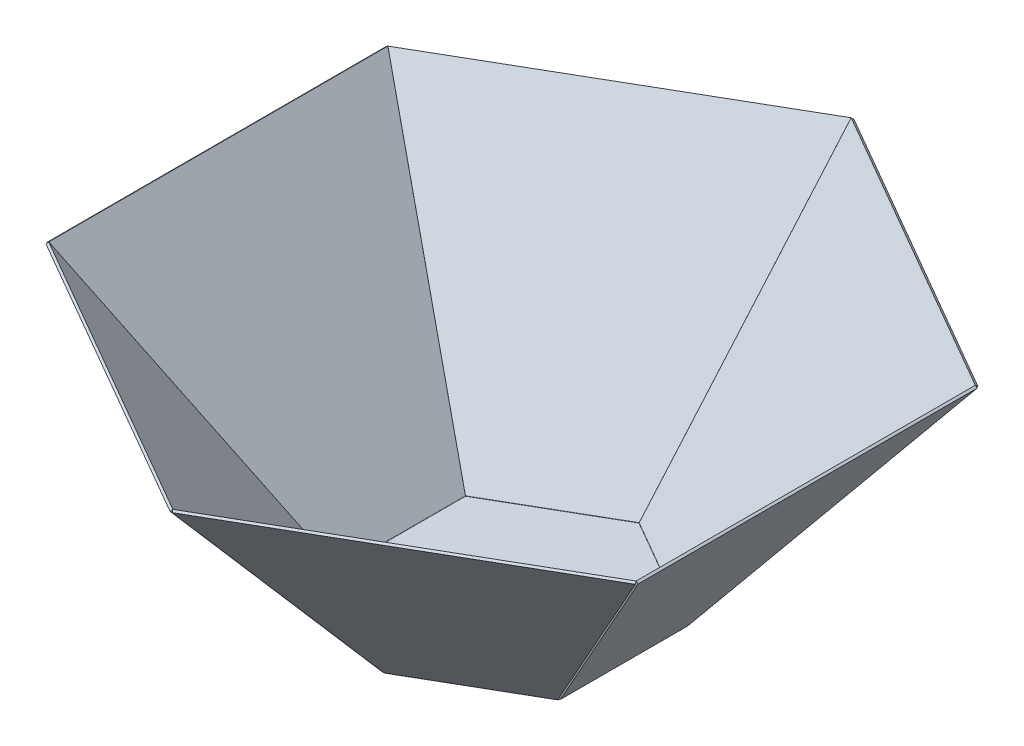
ISO-10303-21;
HEADER;
FILE_DESCRIPTION(('STEP AP214'),'2;1');
FILE_NAME('part.step','',(''),(''),'','','');
FILE_SCHEMA(('AUTOMOTIVE_DESIGN { 1 0 10303 214 1 1 1 1 }'));
ENDSEC;
DATA;
#1=APPLICATION_CONTEXT('core data for automotive mechanical design processes');
#2=APPLICATION_PROTOCOL_DEFINITION('international standard','automotive_design',2000,#1);
#3=PRODUCT_CONTEXT('',#1,'mechanical');
#4=PRODUCT('Part','Part','',(#3));
#5=PRODUCT_RELATED_PRODUCT_CATEGORY('part','',(#4));
#6=PRODUCT_DEFINITION_FORMATION('','',#4);
#7=PRODUCT_DEFINITION_CONTEXT('part definition',#1,'design');
#8=PRODUCT_DEFINITION('design','',#6,#7);
#9=PRODUCT_DEFINITION_SHAPE('','',#8);
#10=(LENGTH_UNIT() NAMED_UNIT(*) SI_UNIT(.MILLI.,.METRE.));
#11=(NAMED_UNIT(*) PLANE_ANGLE_UNIT() SI_UNIT($,.RADIAN.));
#12=(NAMED_UNIT(*) SI_UNIT($,.STERADIAN.) SOLID_ANGLE_UNIT());
#13=UNCERTAINTY_MEASURE_WITH_UNIT(LENGTH_MEASURE(1.E-05),#10,'distance_accuracy_value','');
#14=(GEOMETRIC_REPRESENTATION_CONTEXT(3) GLOBAL_UNCERTAINTY_ASSIGNED_CONTEXT((#13)) GLOBAL_UNIT_ASSIGNED_CONTEXT((#10,
#11,#12)) REPRESENTATION_CONTEXT('',''));
#15=CARTESIAN_POINT('',(0.,0.,0.));
#16=DIRECTION('',(0.,0.,1.));
#17=DIRECTION('',(1.,0.,0.));
#18=AXIS2_PLACEMENT_3D('',#15,#16,#17);
#19=CARTESIAN_POINT('',(-840.523569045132,1135.82999642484,1311.54350837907));
#20=DIRECTION('',(0.916515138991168,0.261861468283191,0.302371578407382));
#21=DIRECTION('',(0.,0.755928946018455,-0.654653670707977));
#22=AXIS2_PLACEMENT_3D('',#19,#20,#21);
#23=PLANE('',#22);
#24=DIRECTION('',(0.4,-0.6,-0.692820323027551));
#25=VECTOR('',#24,1.);
#26=CARTESIAN_POINT('',(-840.523569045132,1760.8228535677,770.283816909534));
#27=LINE('',#26,#25);
#28=CARTESIAN_POINT('',(0.0249999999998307,500.,-685.589010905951));
#29=VERTEX_POINT('',#28);
#30=CARTESIAN_POINT('',(2.02499999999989,497.,-689.053112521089));
#31=VERTEX_POINT('',#30);
#32=EDGE_CURVE('E583',#29,#31,#27,.T.);
#33=ORIENTED_EDGE('',*,*,#32,.T.);
#34=DIRECTION('',(0.,0.755928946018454,-0.654653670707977));
#35=VECTOR('',#34,1.);
#36=CARTESIAN_POINT('',(2.0250000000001,-253.052146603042,-39.4888993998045));
#37=LINE('',#36,#35);
#38=CARTESIAN_POINT('',(2.02500000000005,4.99999999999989,-262.968613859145));
#39=VERTEX_POINT('',#38);
#40=EDGE_CURVE('E463',#39,#31,#37,.T.);
#41=ORIENTED_EDGE('',*,*,#40,.F.);
#42=DIRECTION('',(0.4,-0.6,-0.692820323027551));
#43=VECTOR('',#42,1.);
#44=CARTESIAN_POINT('',(-840.523569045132,1268.8228535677,1196.36831557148));
#45=LINE('',#44,#43);
#46=CARTESIAN_POINT('',(0.0250000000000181,7.99999999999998,-259.504512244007));
#47=VERTEX_POINT('',#46);
#48=EDGE_CURVE('E570',#47,#39,#45,.T.);
#49=ORIENTED_EDGE('',*,*,#48,.F.);
#50=DIRECTION('',(0.,-0.755928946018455,0.654653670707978));
#51=VECTOR('',#50,1.);
#52=CARTESIAN_POINT('',(0.0250000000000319,-124.992857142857,-144.329319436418));
#53=LINE('',#52,#51);
#54=EDGE_CURVE('E107',#29,#47,#53,.T.);
#55=ORIENTED_EDGE('',*,*,#54,.F.);
#56=EDGE_LOOP('',(#33,#41,#49,#55));
#57=FACE_BOUND('',#56,.T.);
#58=ADVANCED_FACE('F95',(#57),#23,.F.);
#59=CARTESIAN_POINT('',(-543.673569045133,1760.8228535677,941.670244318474));
#60=DIRECTION('',(-0.3,-0.8,0.519615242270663));
#61=DIRECTION('',(0.866025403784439,0.,0.5));
#62=AXIS2_PLACEMENT_3D('',#59,#60,#61);
#63=PLANE('',#62);
#64=DIRECTION('',(0.4,-0.6,-0.692820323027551));
#65=VECTOR('',#64,1.);
#66=CARTESIAN_POINT('',(-246.823569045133,1760.8228535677,1113.05667172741));
#67=LINE('',#66,#65);
#68=CARTESIAN_POINT('',(593.724999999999,500.,-342.81615608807));
#69=VERTEX_POINT('',#68);
#70=CARTESIAN_POINT('',(595.724999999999,497.,-346.280257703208));
#71=VERTEX_POINT('',#70);
#72=EDGE_CURVE('E580',#69,#71,#67,.T.);
#73=ORIENTED_EDGE('',*,*,#72,.T.);
#74=DIRECTION('',(-0.866025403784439,0.,-0.5));
#75=VECTOR('',#74,1.);
#76=CARTESIAN_POINT('',(298.875,497.,-517.666685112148));
#77=LINE('',#76,#75);
#78=EDGE_CURVE('E577',#71,#31,#77,.T.);
#79=ORIENTED_EDGE('',*,*,#78,.T.);
#80=ORIENTED_EDGE('',*,*,#32,.F.);
#81=DIRECTION('',(-0.866025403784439,0.,-0.5));
#82=VECTOR('',#81,1.);
#83=CARTESIAN_POINT('',(296.875,500.,-514.202583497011));
#84=LINE('',#83,#82);
#85=EDGE_CURVE('E564',#69,#29,#84,.T.);
#86=ORIENTED_EDGE('',*,*,#85,.F.);
#87=EDGE_LOOP('',(#73,#79,#80,#86));
#88=FACE_BOUND('',#87,.T.);
#89=ADVANCED_FACE('F513',(#88),#63,.F.);
#90=CARTESIAN_POINT('',(-715.568211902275,1135.82999642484,1383.68651746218));
#91=DIRECTION('',(-0.720119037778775,0.26186146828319,-0.642539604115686));
#92=DIRECTION('',(-0.566946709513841,-0.755928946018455,0.327326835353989));
#93=AXIS2_PLACEMENT_3D('',#90,#91,#92);
#94=PLANE('',#93);
#95=DIRECTION('',(0.4,-0.6,-0.692820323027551));
#96=VECTOR('',#95,1.);
#97=CARTESIAN_POINT('',(-615.823569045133,1268.8228535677,1326.09892105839));
#98=LINE('',#97,#96);
#99=CARTESIAN_POINT('',(224.725,7.99999999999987,-129.773906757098));
#100=VERTEX_POINT('',#99);
#101=CARTESIAN_POINT('',(226.725,4.99999999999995,-133.238008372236));
#102=VERTEX_POINT('',#101);
#103=EDGE_CURVE('E575',#100,#102,#98,.T.);
#104=ORIENTED_EDGE('',*,*,#103,.T.);
#105=DIRECTION('',(0.566946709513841,0.755928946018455,-0.327326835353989));
#106=VECTOR('',#105,1.);
#107=CARTESIAN_POINT('',(33.1858900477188,-253.052146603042,-21.4981511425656));
#108=LINE('',#107,#106);
#109=EDGE_CURVE('E484',#102,#71,#108,.T.);
#110=ORIENTED_EDGE('',*,*,#109,.T.);
#111=ORIENTED_EDGE('',*,*,#72,.F.);
#112=DIRECTION('',(0.566946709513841,0.755928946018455,-0.327326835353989));
#113=VECTOR('',#112,1.);
#114=CARTESIAN_POINT('',(124.980357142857,-124.992857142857,-72.1863103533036));
#115=LINE('',#114,#113);
#116=EDGE_CURVE('E566',#100,#69,#115,.T.);
#117=ORIENTED_EDGE('',*,*,#116,.F.);
#118=EDGE_LOOP('',(#104,#110,#111,#117));
#119=FACE_BOUND('',#118,.T.);
#120=ADVANCED_FACE('F512',(#119),#94,.F.);
#121=CARTESIAN_POINT('',(224.775,2.39999999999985,-132.112175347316));
#122=CARTESIAN_POINT('',(222.775,5.39999999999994,-128.648073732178));
#123=B_SPLINE_CURVE_WITH_KNOTS('',1,(#121,#122),.UNSPECIFIED.,.F.,.F.,(2,2),(0.,1.),.UNSPECIFIED.);
#124=CARTESIAN_POINT('',(222.775,5.39999999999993,-128.648073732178));
#125=VERTEX_POINT('',#124);
#126=CARTESIAN_POINT('',(224.775,2.39999999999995,-132.112175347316));
#127=VERTEX_POINT('',#126);
#128=EDGE_CURVE('E472',#125,#127,#123,.F.);
#129=ORIENTED_EDGE('',*,*,#128,.T.);
#130=DIRECTION('',(0.566946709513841,0.755928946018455,-0.327326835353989));
#131=VECTOR('',#130,1.);
#132=CARTESIAN_POINT('',(126.980357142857,-127.992857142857,-75.6504119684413));
#133=LINE('',#132,#131);
#134=EDGE_CURVE('E464',#127,#102,#133,.T.);
#135=ORIENTED_EDGE('',*,*,#134,.T.);
#136=ORIENTED_EDGE('',*,*,#103,.F.);
#137=EDGE_CURVE('E493',#125,#100,#115,.T.);
#138=ORIENTED_EDGE('',*,*,#137,.F.);
#139=EDGE_LOOP('',(#129,#135,#136,#138));
#140=FACE_BOUND('',#139,.T.);
#141=ADVANCED_FACE('F491',(#140),#94,.F.);
#142=CARTESIAN_POINT('',(72.,-108.,-124.707658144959));
#143=DIRECTION('',(-0.4,0.6,0.692820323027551));
#144=DIRECTION('',(0.,-0.755928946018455,0.654653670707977));
#145=AXIS2_PLACEMENT_3D('',#142,#143,#144);
#146=PLANE('',#145);
#147=ORIENTED_EDGE('',*,*,#78,.F.);
#148=ORIENTED_EDGE('',*,*,#109,.F.);
#149=ORIENTED_EDGE('',*,*,#134,.F.);
#150=DIRECTION('',(-0.866025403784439,0.,-0.5));
#151=VECTOR('',#150,1.);
#152=CARTESIAN_POINT('',(224.775,2.3999999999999,-132.112175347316));
#153=LINE('',#152,#151);
#154=CARTESIAN_POINT('',(2.02499999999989,2.39999999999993,-260.716947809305));
#155=VERTEX_POINT('',#154);
#156=EDGE_CURVE('E455',#127,#155,#153,.T.);
#157=ORIENTED_EDGE('',*,*,#156,.T.);
#158=DIRECTION('',(0.,-0.755928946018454,0.654653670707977));
#159=VECTOR('',#158,1.);
#160=CARTESIAN_POINT('',(2.02500000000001,-127.992857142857,-147.793421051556));
#161=LINE('',#160,#159);
#162=EDGE_CURVE('E572',#39,#155,#161,.T.);
#163=ORIENTED_EDGE('',*,*,#162,.F.);
#164=ORIENTED_EDGE('',*,*,#40,.T.);
#165=EDGE_LOOP('',(#147,#148,#149,#157,#163,#164));
#166=FACE_BOUND('',#165,.T.);
#167=ADVANCED_FACE('F482',(#166),#146,.F.);
#168=ORIENTED_EDGE('',*,*,#48,.T.);
#169=ORIENTED_EDGE('',*,*,#162,.T.);
#170=CARTESIAN_POINT('',(0.0250000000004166,5.39999999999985,-257.252846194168));
#171=CARTESIAN_POINT('',(2.02500000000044,2.3999999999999,-260.716947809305));
#172=B_SPLINE_CURVE_WITH_KNOTS('',1,(#170,#171),.UNSPECIFIED.,.F.,.F.,(2,2),(0.,1.),.UNSPECIFIED.);
#173=CARTESIAN_POINT('',(0.0249999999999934,5.3999999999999,-257.252846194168));
#174=VERTEX_POINT('',#173);
#175=EDGE_CURVE('E584',#174,#155,#172,.T.);
#176=ORIENTED_EDGE('',*,*,#175,.F.);
#177=DIRECTION('',(0.,-0.755928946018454,0.654653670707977));
#178=VECTOR('',#177,1.);
#179=CARTESIAN_POINT('',(0.0250000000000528,-124.992857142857,-144.329319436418));
#180=LINE('',#179,#178);
#181=EDGE_CURVE('E13',#47,#174,#180,.T.);
#182=ORIENTED_EDGE('',*,*,#181,.F.);
#183=EDGE_LOOP('',(#168,#169,#176,#182));
#184=FACE_BOUND('',#183,.T.);
#185=ADVANCED_FACE('F515',(#184),#23,.F.);
#186=CARTESIAN_POINT('',(70.,-105.,-121.243556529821));
#187=DIRECTION('',(-0.4,0.6,0.692820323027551));
#188=DIRECTION('',(0.,-0.755928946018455,0.654653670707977));
#189=AXIS2_PLACEMENT_3D('',#186,#187,#188);
#190=PLANE('',#189);
#191=DIRECTION('',(-0.866025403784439,0.,-0.5));
#192=VECTOR('',#191,1.);
#193=CARTESIAN_POINT('',(222.775,5.39999999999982,-128.648073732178));
#194=LINE('',#193,#192);
#195=EDGE_CURVE('E559',#125,#174,#194,.T.);
#196=ORIENTED_EDGE('',*,*,#195,.F.);
#197=ORIENTED_EDGE('',*,*,#137,.T.);
#198=ORIENTED_EDGE('',*,*,#116,.T.);
#199=ORIENTED_EDGE('',*,*,#85,.T.);
#200=ORIENTED_EDGE('',*,*,#54,.T.);
#201=ORIENTED_EDGE('',*,*,#181,.T.);
#202=EDGE_LOOP('',(#196,#197,#198,#199,#200,#201));
#203=FACE_BOUND('',#202,.T.);
#204=ADVANCED_FACE('F97',(#203),#190,.T.);
#205=CARTESIAN_POINT('',(715.568211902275,1135.82999642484,1383.68651746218));
#206=DIRECTION('',(0.720119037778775,0.261861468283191,-0.642539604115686));
#207=DIRECTION('',(-0.566946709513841,0.755928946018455,-0.327326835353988));
#208=AXIS2_PLACEMENT_3D('',#205,#206,#207);
#209=PLANE('',#208);
#210=DIRECTION('',(-0.4,-0.6,-0.692820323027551));
#211=VECTOR('',#210,1.);
#212=CARTESIAN_POINT('',(246.823569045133,1760.8228535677,1113.05667172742));
#213=LINE('',#212,#211);
#214=CARTESIAN_POINT('',(-593.725,500.,-342.81615608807));
#215=VERTEX_POINT('',#214);
#216=CARTESIAN_POINT('',(-595.725,497.,-346.280257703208));
#217=VERTEX_POINT('',#216);
#218=EDGE_CURVE('E1330',#215,#217,#213,.T.);
#219=ORIENTED_EDGE('',*,*,#218,.T.);
#220=DIRECTION('',(-0.566946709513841,0.755928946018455,-0.327326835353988));
#221=VECTOR('',#220,1.);
#222=CARTESIAN_POINT('',(-33.1858900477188,-253.052146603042,-21.4981511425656));
#223=LINE('',#222,#221);
#224=CARTESIAN_POINT('',(-226.725,4.99999999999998,-133.238008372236));
#225=VERTEX_POINT('',#224);
#226=EDGE_CURVE('E1325',#225,#217,#223,.T.);
#227=ORIENTED_EDGE('',*,*,#226,.F.);
#228=DIRECTION('',(-0.4,-0.6,-0.692820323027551));
#229=VECTOR('',#228,1.);
#230=CARTESIAN_POINT('',(615.823569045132,1268.8228535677,1326.09892105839));
#231=LINE('',#230,#229);
#232=CARTESIAN_POINT('',(-224.725,8.00000000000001,-129.773906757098));
#233=VERTEX_POINT('',#232);
#234=EDGE_CURVE('E1302',#233,#225,#231,.T.);
#235=ORIENTED_EDGE('',*,*,#234,.F.);
#236=DIRECTION('',(0.566946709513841,-0.755928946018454,0.327326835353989));
#237=VECTOR('',#236,1.);
#238=CARTESIAN_POINT('',(-124.980357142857,-124.992857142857,-72.1863103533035));
#239=LINE('',#238,#237);
#240=EDGE_CURVE('E1292',#215,#233,#239,.T.);
#241=ORIENTED_EDGE('',*,*,#240,.F.);
#242=EDGE_LOOP('',(#219,#227,#235,#241));
#243=FACE_BOUND('',#242,.T.);
#244=ADVANCED_FACE('F544',(#243),#209,.F.);
#245=CARTESIAN_POINT('',(840.523569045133,1135.82999642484,1311.54350837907));
#246=DIRECTION('',(-0.916515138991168,0.261861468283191,0.302371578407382));
#247=DIRECTION('',(0.,-0.755928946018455,0.654653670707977));
#248=AXIS2_PLACEMENT_3D('',#245,#246,#247);
#249=PLANE('',#248);
#250=DIRECTION('',(-0.4,-0.6,-0.692820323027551));
#251=VECTOR('',#250,1.);
#252=CARTESIAN_POINT('',(840.523569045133,1268.8228535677,1196.36831557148));
#253=LINE('',#252,#251);
#254=CARTESIAN_POINT('',(-0.0249999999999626,8.00000000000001,-259.504512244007));
#255=VERTEX_POINT('',#254);
#256=CARTESIAN_POINT('',(-2.02500000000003,4.99999999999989,-262.968613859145));
#257=VERTEX_POINT('',#256);
#258=EDGE_CURVE('E1333',#255,#257,#253,.T.);
#259=ORIENTED_EDGE('',*,*,#258,.T.);
#260=DIRECTION('',(0.,0.755928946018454,-0.654653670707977));
#261=VECTOR('',#260,1.);
#262=CARTESIAN_POINT('',(-2.02500000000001,-253.052146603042,-39.4888993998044));
#263=LINE('',#262,#261);
#264=CARTESIAN_POINT('',(-2.02500000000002,497.,-689.053112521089));
#265=VERTEX_POINT('',#264);
#266=EDGE_CURVE('E1336',#257,#265,#263,.T.);
#267=ORIENTED_EDGE('',*,*,#266,.T.);
#268=DIRECTION('',(-0.4,-0.6,-0.692820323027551));
#269=VECTOR('',#268,1.);
#270=CARTESIAN_POINT('',(840.523569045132,1760.8228535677,770.283816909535));
#271=LINE('',#270,#269);
#272=CARTESIAN_POINT('',(-0.0250000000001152,500.,-685.589010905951));
#273=VERTEX_POINT('',#272);
#274=EDGE_CURVE('E1339',#273,#265,#271,.T.);
#275=ORIENTED_EDGE('',*,*,#274,.F.);
#276=DIRECTION('',(0.,0.755928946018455,-0.654653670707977));
#277=VECTOR('',#276,1.);
#278=CARTESIAN_POINT('',(-0.0249999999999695,-124.992857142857,-144.329319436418));
#279=LINE('',#278,#277);
#280=EDGE_CURVE('E1298',#255,#273,#279,.T.);
#281=ORIENTED_EDGE('',*,*,#280,.F.);
#282=EDGE_LOOP('',(#259,#267,#275,#281));
#283=FACE_BOUND('',#282,.T.);
#284=ADVANCED_FACE('F538',(#283),#249,.F.);
#285=CARTESIAN_POINT('',(543.673569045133,1760.8228535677,941.670244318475));
#286=DIRECTION('',(0.3,-0.8,0.519615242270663));
#287=DIRECTION('',(0.866025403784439,0.,-0.5));
#288=AXIS2_PLACEMENT_3D('',#285,#286,#287);
#289=PLANE('',#288);
#290=ORIENTED_EDGE('',*,*,#274,.T.);
#291=DIRECTION('',(-0.866025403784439,0.,0.5));
#292=VECTOR('',#291,1.);
#293=CARTESIAN_POINT('',(-298.875,497.,-517.666685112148));
#294=LINE('',#293,#292);
#295=EDGE_CURVE('E1326',#265,#217,#294,.T.);
#296=ORIENTED_EDGE('',*,*,#295,.T.);
#297=ORIENTED_EDGE('',*,*,#218,.F.);
#298=DIRECTION('',(-0.866025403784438,0.,0.5));
#299=VECTOR('',#298,1.);
#300=CARTESIAN_POINT('',(-296.875,500.,-514.202583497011));
#301=LINE('',#300,#299);
#302=EDGE_CURVE('E1295',#273,#215,#301,.T.);
#303=ORIENTED_EDGE('',*,*,#302,.F.);
#304=EDGE_LOOP('',(#290,#296,#297,#303));
#305=FACE_BOUND('',#304,.T.);
#306=ADVANCED_FACE('F535',(#305),#289,.F.);
#307=CARTESIAN_POINT('',(-72.,-108.,-124.707658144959));
#308=DIRECTION('',(0.4,0.6,0.692820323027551));
#309=DIRECTION('',(0.,-0.755928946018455,0.654653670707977));
#310=AXIS2_PLACEMENT_3D('',#307,#308,#309);
#311=PLANE('',#310);
#312=ORIENTED_EDGE('',*,*,#295,.F.);
#313=ORIENTED_EDGE('',*,*,#266,.F.);
#314=DIRECTION('',(0.,0.755928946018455,-0.654653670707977));
#315=VECTOR('',#314,1.);
#316=CARTESIAN_POINT('',(-2.02499999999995,-127.992857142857,-147.793421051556));
#317=LINE('',#316,#315);
#318=CARTESIAN_POINT('',(-2.02499999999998,2.39999999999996,-260.716947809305));
#319=VERTEX_POINT('',#318);
#320=EDGE_CURVE('E198',#319,#257,#317,.T.);
#321=ORIENTED_EDGE('',*,*,#320,.F.);
#322=DIRECTION('',(-0.866025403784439,0.,0.5));
#323=VECTOR('',#322,1.);
#324=CARTESIAN_POINT('',(-2.02499999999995,2.39999999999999,-260.716947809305));
#325=LINE('',#324,#323);
#326=CARTESIAN_POINT('',(-224.775,2.40000000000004,-132.112175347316));
#327=VERTEX_POINT('',#326);
#328=EDGE_CURVE('E1323',#319,#327,#325,.T.);
#329=ORIENTED_EDGE('',*,*,#328,.T.);
#330=DIRECTION('',(0.566946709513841,-0.755928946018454,0.327326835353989));
#331=VECTOR('',#330,1.);
#332=CARTESIAN_POINT('',(-126.980357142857,-127.992857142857,-75.6504119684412));
#333=LINE('',#332,#331);
#334=EDGE_CURVE('E1305',#225,#327,#333,.T.);
#335=ORIENTED_EDGE('',*,*,#334,.F.);
#336=ORIENTED_EDGE('',*,*,#226,.T.);
#337=EDGE_LOOP('',(#312,#313,#321,#329,#335,#336));
#338=FACE_BOUND('',#337,.T.);
#339=ADVANCED_FACE('F532',(#338),#311,.F.);
#340=ORIENTED_EDGE('',*,*,#234,.T.);
#341=ORIENTED_EDGE('',*,*,#334,.T.);
#342=CARTESIAN_POINT('',(-222.775,5.39999999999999,-128.648073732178));
#343=CARTESIAN_POINT('',(-224.775,2.4000000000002,-132.112175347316));
#344=B_SPLINE_CURVE_WITH_KNOTS('',1,(#342,#343),.UNSPECIFIED.,.F.,.F.,(2,2),(0.,1.),.UNSPECIFIED.);
#345=CARTESIAN_POINT('',(-222.775,5.40000000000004,-128.648073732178));
#346=VERTEX_POINT('',#345);
#347=EDGE_CURVE('E1285',#346,#327,#344,.T.);
#348=ORIENTED_EDGE('',*,*,#347,.F.);
#349=DIRECTION('',(0.566946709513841,-0.755928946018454,0.327326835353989));
#350=VECTOR('',#349,1.);
#351=CARTESIAN_POINT('',(-124.980357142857,-124.992857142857,-72.1863103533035));
#352=LINE('',#351,#350);
#353=EDGE_CURVE('E158',#233,#346,#352,.T.);
#354=ORIENTED_EDGE('',*,*,#353,.F.);
#355=EDGE_LOOP('',(#340,#341,#348,#354));
#356=FACE_BOUND('',#355,.T.);
#357=ADVANCED_FACE('F530',(#356),#209,.F.);
#358=CARTESIAN_POINT('',(-70.,-105.,-121.243556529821));
#359=DIRECTION('',(0.4,0.6,0.692820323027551));
#360=DIRECTION('',(0.,-0.755928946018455,0.654653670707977));
#361=AXIS2_PLACEMENT_3D('',#358,#359,#360);
#362=PLANE('',#361);
#363=DIRECTION('',(-0.866025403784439,0.,0.5));
#364=VECTOR('',#363,1.);
#365=CARTESIAN_POINT('',(-0.0249999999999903,5.39999999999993,-257.252846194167));
#366=LINE('',#365,#364);
#367=CARTESIAN_POINT('',(-0.0249999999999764,5.39999999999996,-257.252846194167));
#368=VERTEX_POINT('',#367);
#369=EDGE_CURVE('E1282',#368,#346,#366,.T.);
#370=ORIENTED_EDGE('',*,*,#369,.F.);
#371=EDGE_CURVE('E191',#368,#255,#279,.T.);
#372=ORIENTED_EDGE('',*,*,#371,.T.);
#373=ORIENTED_EDGE('',*,*,#280,.T.);
#374=ORIENTED_EDGE('',*,*,#302,.T.);
#375=ORIENTED_EDGE('',*,*,#240,.T.);
#376=ORIENTED_EDGE('',*,*,#353,.T.);
#377=EDGE_LOOP('',(#370,#372,#373,#374,#375,#376));
#378=FACE_BOUND('',#377,.T.);
#379=ADVANCED_FACE('F526',(#378),#362,.T.);
#380=CARTESIAN_POINT('',(-2.02499999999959,2.40000000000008,-260.716947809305));
#381=CARTESIAN_POINT('',(-0.0249999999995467,5.39999999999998,-257.252846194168));
#382=B_SPLINE_CURVE_WITH_KNOTS('',1,(#380,#381),.UNSPECIFIED.,.F.,.F.,(2,2),(0.,1.),.UNSPECIFIED.);
#383=EDGE_CURVE('E560',#368,#319,#382,.F.);
#384=ORIENTED_EDGE('',*,*,#383,.T.);
#385=ORIENTED_EDGE('',*,*,#320,.T.);
#386=ORIENTED_EDGE('',*,*,#258,.F.);
#387=ORIENTED_EDGE('',*,*,#371,.F.);
#388=EDGE_LOOP('',(#384,#385,#386,#387));
#389=FACE_BOUND('',#388,.T.);
#390=ADVANCED_FACE('F529',(#389),#249,.F.);
#391=CARTESIAN_POINT('',(1348.03469485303,979.787181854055,72.1430090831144));
#392=DIRECTION('',(-0.196396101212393,0.261861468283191,-0.944911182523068));
#393=DIRECTION('',(-0.566946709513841,0.755928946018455,0.327326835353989));
#394=AXIS2_PLACEMENT_3D('',#391,#392,#393);
#395=PLANE('',#394);
#396=DIRECTION('',(-0.8,-0.6,0.));
#397=VECTOR('',#396,1.);
#398=CARTESIAN_POINT('',(879.290051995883,1604.78003899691,342.772854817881));
#399=LINE('',#398,#397);
#400=CARTESIAN_POINT('',(-593.75,500.,342.772854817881));
#401=VERTEX_POINT('',#400);
#402=CARTESIAN_POINT('',(-597.75,497.,342.772854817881));
#403=VERTEX_POINT('',#402);
#404=EDGE_CURVE('E1135',#401,#403,#399,.T.);
#405=ORIENTED_EDGE('',*,*,#404,.T.);
#406=DIRECTION('',(-0.566946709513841,0.755928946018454,0.327326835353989));
#407=VECTOR('',#406,1.);
#408=CARTESIAN_POINT('',(-35.2108900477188,-253.052146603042,17.9907482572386));
#409=LINE('',#408,#407);
#410=CARTESIAN_POINT('',(-228.75,4.99999999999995,129.730605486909));
#411=VERTEX_POINT('',#410);
#412=EDGE_CURVE('E1120',#411,#403,#409,.T.);
#413=ORIENTED_EDGE('',*,*,#412,.F.);
#414=DIRECTION('',(-0.8,-0.6,0.));
#415=VECTOR('',#414,1.);
#416=CARTESIAN_POINT('',(1248.29005199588,1112.78003899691,129.730605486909));
#417=LINE('',#416,#415);
#418=CARTESIAN_POINT('',(-224.75,8.00000000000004,129.730605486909));
#419=VERTEX_POINT('',#418);
#420=EDGE_CURVE('E1118',#419,#411,#417,.T.);
#421=ORIENTED_EDGE('',*,*,#420,.F.);
#422=DIRECTION('',(0.566946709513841,-0.755928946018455,-0.327326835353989));
#423=VECTOR('',#422,1.);
#424=CARTESIAN_POINT('',(-125.005357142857,-124.992857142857,72.1430090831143));
#425=LINE('',#424,#423);
#426=EDGE_CURVE('E238',#401,#419,#425,.T.);
#427=ORIENTED_EDGE('',*,*,#426,.F.);
#428=EDGE_LOOP('',(#405,#413,#421,#427));
#429=FACE_BOUND('',#428,.T.);
#430=ADVANCED_FACE('F543',(#429),#395,.F.);
#431=CARTESIAN_POINT('',(1348.03469485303,979.787181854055,-72.1430090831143));
#432=DIRECTION('',(-0.196396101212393,0.261861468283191,0.944911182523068));
#433=DIRECTION('',(0.566946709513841,-0.755928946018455,0.327326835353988));
#434=AXIS2_PLACEMENT_3D('',#431,#432,#433);
#435=PLANE('',#434);
#436=DIRECTION('',(-0.8,-0.6,0.));
#437=VECTOR('',#436,1.);
#438=CARTESIAN_POINT('',(1248.29005199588,1112.78003899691,-129.730605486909));
#439=LINE('',#438,#437);
#440=CARTESIAN_POINT('',(-224.75,8.00000000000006,-129.730605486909));
#441=VERTEX_POINT('',#440);
#442=CARTESIAN_POINT('',(-228.75,5.,-129.730605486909));
#443=VERTEX_POINT('',#442);
#444=EDGE_CURVE('E1132',#441,#443,#439,.T.);
#445=ORIENTED_EDGE('',*,*,#444,.T.);
#446=DIRECTION('',(-0.566946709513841,0.755928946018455,-0.327326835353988));
#447=VECTOR('',#446,1.);
#448=CARTESIAN_POINT('',(-35.2108900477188,-253.052146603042,-17.9907482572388));
#449=LINE('',#448,#447);
#450=CARTESIAN_POINT('',(-597.75,497.,-342.772854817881));
#451=VERTEX_POINT('',#450);
#452=EDGE_CURVE('E1129',#443,#451,#449,.T.);
#453=ORIENTED_EDGE('',*,*,#452,.T.);
#454=DIRECTION('',(-0.8,-0.6,0.));
#455=VECTOR('',#454,1.);
#456=CARTESIAN_POINT('',(879.290051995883,1604.78003899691,-342.77285481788));
#457=LINE('',#456,#455);
#458=CARTESIAN_POINT('',(-593.75,500.,-342.772854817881));
#459=VERTEX_POINT('',#458);
#460=EDGE_CURVE('E1126',#459,#451,#457,.T.);
#461=ORIENTED_EDGE('',*,*,#460,.F.);
#462=DIRECTION('',(-0.566946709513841,0.755928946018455,-0.327326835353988));
#463=VECTOR('',#462,1.);
#464=CARTESIAN_POINT('',(-125.005357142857,-124.992857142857,-72.1430090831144));
#465=LINE('',#464,#463);
#466=EDGE_CURVE('E1109',#441,#459,#465,.T.);
#467=ORIENTED_EDGE('',*,*,#466,.F.);
#468=EDGE_LOOP('',(#445,#453,#461,#467));
#469=FACE_BOUND('',#468,.T.);
#470=ADVANCED_FACE('F1081',(#469),#435,.F.);
#471=CARTESIAN_POINT('',(879.290051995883,1604.78003899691,2.84578100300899E-13));
#472=DIRECTION('',(0.6,-0.8,0.));
#473=DIRECTION('',(0.,0.,-1.));
#474=AXIS2_PLACEMENT_3D('',#471,#472,#473);
#475=PLANE('',#474);
#476=ORIENTED_EDGE('',*,*,#460,.T.);
#477=DIRECTION('',(0.,0.,1.));
#478=VECTOR('',#477,1.);
#479=CARTESIAN_POINT('',(-597.75,497.,1.84826298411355E-13));
#480=LINE('',#479,#478);
#481=EDGE_CURVE('E1123',#451,#403,#480,.T.);
#482=ORIENTED_EDGE('',*,*,#481,.T.);
#483=ORIENTED_EDGE('',*,*,#404,.F.);
#484=DIRECTION('',(0.,0.,1.));
#485=VECTOR('',#484,1.);
#486=CARTESIAN_POINT('',(-593.75,500.,1.850964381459E-13));
#487=LINE('',#486,#485);
#488=EDGE_CURVE('E1116',#459,#401,#487,.T.);
#489=ORIENTED_EDGE('',*,*,#488,.F.);
#490=EDGE_LOOP('',(#476,#482,#483,#489));
#491=FACE_BOUND('',#490,.T.);
#492=ADVANCED_FACE('F1711',(#491),#475,.F.);
#493=CARTESIAN_POINT('',(-144.,-108.,0.));
#494=DIRECTION('',(0.8,0.6,0.));
#495=DIRECTION('',(-0.6,0.8,0.));
#496=AXIS2_PLACEMENT_3D('',#493,#494,#495);
#497=PLANE('',#496);
#498=ORIENTED_EDGE('',*,*,#481,.F.);
#499=ORIENTED_EDGE('',*,*,#452,.F.);
#500=DIRECTION('',(-0.566946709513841,0.755928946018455,-0.327326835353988));
#501=VECTOR('',#500,1.);
#502=CARTESIAN_POINT('',(-129.005357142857,-127.992857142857,-72.1430090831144));
#503=LINE('',#502,#501);
#504=CARTESIAN_POINT('',(-226.8,2.39999999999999,-128.604772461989));
#505=VERTEX_POINT('',#504);
#506=EDGE_CURVE('E1281',#505,#443,#503,.T.);
#507=ORIENTED_EDGE('',*,*,#506,.F.);
#508=DIRECTION('',(0.,0.,1.));
#509=VECTOR('',#508,1.);
#510=CARTESIAN_POINT('',(-226.8,2.39999999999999,-128.604772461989));
#511=LINE('',#510,#509);
#512=CARTESIAN_POINT('',(-226.8,2.40000000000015,128.604772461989));
#513=VERTEX_POINT('',#512);
#514=EDGE_CURVE('E1122',#505,#513,#511,.T.);
#515=ORIENTED_EDGE('',*,*,#514,.T.);
#516=DIRECTION('',(0.566946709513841,-0.755928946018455,-0.327326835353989));
#517=VECTOR('',#516,1.);
#518=CARTESIAN_POINT('',(-129.005357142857,-127.992857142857,72.1430090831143));
#519=LINE('',#518,#517);
#520=EDGE_CURVE('E1110',#411,#513,#519,.T.);
#521=ORIENTED_EDGE('',*,*,#520,.F.);
#522=ORIENTED_EDGE('',*,*,#412,.T.);
#523=EDGE_LOOP('',(#498,#499,#507,#515,#521,#522));
#524=FACE_BOUND('',#523,.T.);
#525=ADVANCED_FACE('F1716',(#524),#497,.F.);
#526=ORIENTED_EDGE('',*,*,#420,.T.);
#527=ORIENTED_EDGE('',*,*,#520,.T.);
#528=CARTESIAN_POINT('',(-222.8,5.39999999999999,128.604772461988));
#529=CARTESIAN_POINT('',(-226.8,2.40000000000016,128.604772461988));
#530=B_SPLINE_CURVE_WITH_KNOTS('',1,(#528,#529),.UNSPECIFIED.,.F.,.F.,(2,2),(0.,1.),.UNSPECIFIED.);
#531=CARTESIAN_POINT('',(-222.8,5.40000000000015,128.604772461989));
#532=VERTEX_POINT('',#531);
#533=EDGE_CURVE('E1104',#532,#513,#530,.T.);
#534=ORIENTED_EDGE('',*,*,#533,.F.);
#535=DIRECTION('',(0.566946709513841,-0.755928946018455,-0.327326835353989));
#536=VECTOR('',#535,1.);
#537=CARTESIAN_POINT('',(-125.005357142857,-124.992857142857,72.1430090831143));
#538=LINE('',#537,#536);
#539=EDGE_CURVE('E206',#419,#532,#538,.T.);
#540=ORIENTED_EDGE('',*,*,#539,.F.);
#541=EDGE_LOOP('',(#526,#527,#534,#540));
#542=FACE_BOUND('',#541,.T.);
#543=ADVANCED_FACE('F1082',(#542),#395,.F.);
#544=CARTESIAN_POINT('',(-140.,-105.,0.));
#545=DIRECTION('',(0.8,0.6,0.));
#546=DIRECTION('',(-0.6,0.8,0.));
#547=AXIS2_PLACEMENT_3D('',#544,#545,#546);
#548=PLANE('',#547);
#549=DIRECTION('',(0.,0.,1.));
#550=VECTOR('',#549,1.);
#551=CARTESIAN_POINT('',(-222.8,5.40000000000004,-128.604772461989));
#552=LINE('',#551,#550);
#553=CARTESIAN_POINT('',(-222.8,5.39999999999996,-128.604772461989));
#554=VERTEX_POINT('',#553);
#555=EDGE_CURVE('E1101',#554,#532,#552,.T.);
#556=ORIENTED_EDGE('',*,*,#555,.F.);
#557=EDGE_CURVE('E246',#554,#441,#465,.T.);
#558=ORIENTED_EDGE('',*,*,#557,.T.);
#559=ORIENTED_EDGE('',*,*,#466,.T.);
#560=ORIENTED_EDGE('',*,*,#488,.T.);
#561=ORIENTED_EDGE('',*,*,#426,.T.);
#562=ORIENTED_EDGE('',*,*,#539,.T.);
#563=EDGE_LOOP('',(#556,#558,#559,#560,#561,#562));
#564=FACE_BOUND('',#563,.T.);
#565=ADVANCED_FACE('F1491',(#564),#548,.T.);
#566=CARTESIAN_POINT('',(-226.8,2.4,-128.60477246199));
#567=CARTESIAN_POINT('',(-222.8,5.39999999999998,-128.60477246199));
#568=B_SPLINE_CURVE_WITH_KNOTS('',1,(#566,#567),.UNSPECIFIED.,.F.,.F.,(2,2),(0.,1.),.UNSPECIFIED.);
#569=EDGE_CURVE('E1098',#554,#505,#568,.F.);
#570=ORIENTED_EDGE('',*,*,#569,.T.);
#571=ORIENTED_EDGE('',*,*,#506,.T.);
#572=ORIENTED_EDGE('',*,*,#444,.F.);
#573=ORIENTED_EDGE('',*,*,#557,.F.);
#574=EDGE_LOOP('',(#570,#571,#572,#573));
#575=FACE_BOUND('',#574,.T.);
#576=ADVANCED_FACE('F1083',(#575),#435,.F.);
#577=CARTESIAN_POINT('',(840.523569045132,1135.82999642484,-1311.54350837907));
#578=DIRECTION('',(-0.916515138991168,0.261861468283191,-0.302371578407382));
#579=DIRECTION('',(0.,0.755928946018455,0.654653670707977));
#580=AXIS2_PLACEMENT_3D('',#577,#578,#579);
#581=PLANE('',#580);
#582=DIRECTION('',(-0.4,-0.6,0.692820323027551));
#583=VECTOR('',#582,1.);
#584=CARTESIAN_POINT('',(840.523569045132,1760.8228535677,-770.283816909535));
#585=LINE('',#584,#583);
#586=CARTESIAN_POINT('',(-0.0249999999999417,500.,685.589010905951));
#587=VERTEX_POINT('',#586);
#588=CARTESIAN_POINT('',(-2.02500000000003,497.,689.053112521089));
#589=VERTEX_POINT('',#588);
#590=EDGE_CURVE('E1662',#587,#589,#585,.T.);
#591=ORIENTED_EDGE('',*,*,#590,.T.);
#592=DIRECTION('',(0.,0.755928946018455,0.654653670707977));
#593=VECTOR('',#592,1.);
#594=CARTESIAN_POINT('',(-2.025,-253.052146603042,39.4888993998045));
#595=LINE('',#594,#593);
#596=CARTESIAN_POINT('',(-2.02500000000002,4.99999999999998,262.968613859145));
#597=VERTEX_POINT('',#596);
#598=EDGE_CURVE('E1678',#597,#589,#595,.T.);
#599=ORIENTED_EDGE('',*,*,#598,.F.);
#600=DIRECTION('',(-0.4,-0.6,0.692820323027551));
#601=VECTOR('',#600,1.);
#602=CARTESIAN_POINT('',(840.523569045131,1268.8228535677,-1196.36831557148));
#603=LINE('',#602,#601);
#604=CARTESIAN_POINT('',(-0.0249999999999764,8.00000000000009,259.504512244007));
#605=VERTEX_POINT('',#604);
#606=EDGE_CURVE('E1036',#605,#597,#603,.T.);
#607=ORIENTED_EDGE('',*,*,#606,.F.);
#608=DIRECTION('',(0.,-0.755928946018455,-0.654653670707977));
#609=VECTOR('',#608,1.);
#610=CARTESIAN_POINT('',(-0.0249999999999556,-124.992857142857,144.329319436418));
#611=LINE('',#610,#609);
#612=EDGE_CURVE('E1026',#587,#605,#611,.T.);
#613=ORIENTED_EDGE('',*,*,#612,.F.);
#614=EDGE_LOOP('',(#591,#599,#607,#613));
#615=FACE_BOUND('',#614,.T.);
#616=ADVANCED_FACE('F1064',(#615),#581,.F.);
#617=CARTESIAN_POINT('',(715.568211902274,1135.82999642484,-1383.68651746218));
#618=DIRECTION('',(0.720119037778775,0.261861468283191,0.642539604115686));
#619=DIRECTION('',(0.566946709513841,-0.755928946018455,-0.327326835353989));
#620=AXIS2_PLACEMENT_3D('',#617,#618,#619);
#621=PLANE('',#620);
#622=DIRECTION('',(-0.4,-0.6,0.692820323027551));
#623=VECTOR('',#622,1.);
#624=CARTESIAN_POINT('',(615.823569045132,1268.8228535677,-1326.09892105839));
#625=LINE('',#624,#623);
#626=CARTESIAN_POINT('',(-224.725,7.99999999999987,129.773906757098));
#627=VERTEX_POINT('',#626);
#628=CARTESIAN_POINT('',(-226.725,4.99999999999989,133.238008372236));
#629=VERTEX_POINT('',#628);
#630=EDGE_CURVE('E1664',#627,#629,#625,.T.);
#631=ORIENTED_EDGE('',*,*,#630,.T.);
#632=DIRECTION('',(-0.566946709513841,0.755928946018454,0.327326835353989));
#633=VECTOR('',#632,1.);
#634=CARTESIAN_POINT('',(-33.1858900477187,-253.052146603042,21.4981511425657));
#635=LINE('',#634,#633);
#636=CARTESIAN_POINT('',(-595.725,497.,346.280257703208));
#637=VERTEX_POINT('',#636);
#638=EDGE_CURVE('E1670',#629,#637,#635,.T.);
#639=ORIENTED_EDGE('',*,*,#638,.T.);
#640=DIRECTION('',(-0.4,-0.6,0.692820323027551));
#641=VECTOR('',#640,1.);
#642=CARTESIAN_POINT('',(246.823569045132,1760.8228535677,-1113.05667172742));
#643=LINE('',#642,#641);
#644=CARTESIAN_POINT('',(-593.725,500.,342.81615608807));
#645=VERTEX_POINT('',#644);
#646=EDGE_CURVE('E1692',#645,#637,#643,.T.);
#647=ORIENTED_EDGE('',*,*,#646,.F.);
#648=DIRECTION('',(-0.566946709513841,0.755928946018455,0.327326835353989));
#649=VECTOR('',#648,1.);
#650=CARTESIAN_POINT('',(-124.980357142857,-124.992857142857,72.1863103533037));
#651=LINE('',#650,#649);
#652=EDGE_CURVE('E1032',#627,#645,#651,.T.);
#653=ORIENTED_EDGE('',*,*,#652,.F.);
#654=EDGE_LOOP('',(#631,#639,#647,#653));
#655=FACE_BOUND('',#654,.T.);
#656=ADVANCED_FACE('F1063',(#655),#621,.F.);
#657=CARTESIAN_POINT('',(543.673569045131,1760.8228535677,-941.670244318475));
#658=DIRECTION('',(0.3,-0.8,-0.519615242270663));
#659=DIRECTION('',(-0.866025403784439,0.,-0.5));
#660=AXIS2_PLACEMENT_3D('',#657,#658,#659);
#661=PLANE('',#660);
#662=ORIENTED_EDGE('',*,*,#646,.T.);
#663=DIRECTION('',(0.866025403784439,0.,0.5));
#664=VECTOR('',#663,1.);
#665=CARTESIAN_POINT('',(-298.875,497.,517.666685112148));
#666=LINE('',#665,#664);
#667=EDGE_CURVE('E1679',#637,#589,#666,.T.);
#668=ORIENTED_EDGE('',*,*,#667,.T.);
#669=ORIENTED_EDGE('',*,*,#590,.F.);
#670=DIRECTION('',(0.866025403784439,0.,0.5));
#671=VECTOR('',#670,1.);
#672=CARTESIAN_POINT('',(-296.875,500.,514.202583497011));
#673=LINE('',#672,#671);
#674=EDGE_CURVE('E1029',#645,#587,#673,.T.);
#675=ORIENTED_EDGE('',*,*,#674,.F.);
#676=EDGE_LOOP('',(#662,#668,#669,#675));
#677=FACE_BOUND('',#676,.T.);
#678=ADVANCED_FACE('F1067',(#677),#661,.F.);
#679=CARTESIAN_POINT('',(-72.,-108.,124.707658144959));
#680=DIRECTION('',(0.4,0.6,-0.692820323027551));
#681=DIRECTION('',(0.,0.755928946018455,0.654653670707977));
#682=AXIS2_PLACEMENT_3D('',#679,#680,#681);
#683=PLANE('',#682);
#684=ORIENTED_EDGE('',*,*,#667,.F.);
#685=ORIENTED_EDGE('',*,*,#638,.F.);
#686=DIRECTION('',(-0.566946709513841,0.755928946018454,0.327326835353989));
#687=VECTOR('',#686,1.);
#688=CARTESIAN_POINT('',(-126.980357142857,-127.992857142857,75.6504119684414));
#689=LINE('',#688,#687);
#690=CARTESIAN_POINT('',(-224.775,2.3999999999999,132.112175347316));
#691=VERTEX_POINT('',#690);
#692=EDGE_CURVE('E295',#691,#629,#689,.T.);
#693=ORIENTED_EDGE('',*,*,#692,.F.);
#694=DIRECTION('',(0.866025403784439,0.,0.5));
#695=VECTOR('',#694,1.);
#696=CARTESIAN_POINT('',(-224.775,2.39999999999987,132.112175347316));
#697=LINE('',#696,#695);
#698=CARTESIAN_POINT('',(-2.02499999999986,2.40000000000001,260.716947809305));
#699=VERTEX_POINT('',#698);
#700=EDGE_CURVE('E1521',#691,#699,#697,.T.);
#701=ORIENTED_EDGE('',*,*,#700,.T.);
#702=DIRECTION('',(0.,-0.755928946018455,-0.654653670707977));
#703=VECTOR('',#702,1.);
#704=CARTESIAN_POINT('',(-2.02499999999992,-127.992857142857,147.793421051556));
#705=LINE('',#704,#703);
#706=EDGE_CURVE('E1041',#597,#699,#705,.T.);
#707=ORIENTED_EDGE('',*,*,#706,.F.);
#708=ORIENTED_EDGE('',*,*,#598,.T.);
#709=EDGE_LOOP('',(#684,#685,#693,#701,#707,#708));
#710=FACE_BOUND('',#709,.T.);
#711=ADVANCED_FACE('F1070',(#710),#683,.F.);
#712=ORIENTED_EDGE('',*,*,#606,.T.);
#713=ORIENTED_EDGE('',*,*,#706,.T.);
#714=CARTESIAN_POINT('',(-0.0249999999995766,5.40000000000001,257.252846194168));
#715=CARTESIAN_POINT('',(-2.02499999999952,2.39999999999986,260.716947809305));
#716=B_SPLINE_CURVE_WITH_KNOTS('',1,(#714,#715),.UNSPECIFIED.,.F.,.F.,(2,2),(0.,1.),.UNSPECIFIED.);
#717=CARTESIAN_POINT('',(-0.0249999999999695,5.40000000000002,257.252846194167));
#718=VERTEX_POINT('',#717);
#719=EDGE_CURVE('E1009',#718,#699,#716,.T.);
#720=ORIENTED_EDGE('',*,*,#719,.F.);
#721=DIRECTION('',(0.,-0.755928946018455,-0.654653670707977));
#722=VECTOR('',#721,1.);
#723=CARTESIAN_POINT('',(-0.0249999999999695,-124.992857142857,144.329319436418));
#724=LINE('',#723,#722);
#725=EDGE_CURVE('E255',#605,#718,#724,.T.);
#726=ORIENTED_EDGE('',*,*,#725,.F.);
#727=EDGE_LOOP('',(#712,#713,#720,#726));
#728=FACE_BOUND('',#727,.T.);
#729=ADVANCED_FACE('F1074',(#728),#581,.F.);
#730=CARTESIAN_POINT('',(-70.,-105.,121.243556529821));
#731=DIRECTION('',(0.4,0.6,-0.692820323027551));
#732=DIRECTION('',(0.,0.755928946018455,0.654653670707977));
#733=AXIS2_PLACEMENT_3D('',#730,#731,#732);
#734=PLANE('',#733);
#735=DIRECTION('',(0.866025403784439,0.,0.5));
#736=VECTOR('',#735,1.);
#737=CARTESIAN_POINT('',(-222.775,5.39999999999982,128.648073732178));
#738=LINE('',#737,#736);
#739=CARTESIAN_POINT('',(-222.775,5.39999999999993,128.648073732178));
#740=VERTEX_POINT('',#739);
#741=EDGE_CURVE('E1006',#740,#718,#738,.T.);
#742=ORIENTED_EDGE('',*,*,#741,.F.);
#743=EDGE_CURVE('E288',#740,#627,#651,.T.);
#744=ORIENTED_EDGE('',*,*,#743,.T.);
#745=ORIENTED_EDGE('',*,*,#652,.T.);
#746=ORIENTED_EDGE('',*,*,#674,.T.);
#747=ORIENTED_EDGE('',*,*,#612,.T.);
#748=ORIENTED_EDGE('',*,*,#725,.T.);
#749=EDGE_LOOP('',(#742,#744,#745,#746,#747,#748));
#750=FACE_BOUND('',#749,.T.);
#751=ADVANCED_FACE('F1062',(#750),#734,.T.);
#752=CARTESIAN_POINT('',(-224.775,2.39999999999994,132.112175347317));
#753=CARTESIAN_POINT('',(-222.775,5.39999999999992,128.648073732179));
#754=B_SPLINE_CURVE_WITH_KNOTS('',1,(#752,#753),.UNSPECIFIED.,.F.,.F.,(2,2),(0.,1.),.UNSPECIFIED.);
#755=EDGE_CURVE('E1046',#740,#691,#754,.F.);
#756=ORIENTED_EDGE('',*,*,#755,.T.);
#757=ORIENTED_EDGE('',*,*,#692,.T.);
#758=ORIENTED_EDGE('',*,*,#630,.F.);
#759=ORIENTED_EDGE('',*,*,#743,.F.);
#760=EDGE_LOOP('',(#756,#757,#758,#759));
#761=FACE_BOUND('',#760,.T.);
#762=ADVANCED_FACE('F806',(#761),#621,.F.);
#763=CARTESIAN_POINT('',(-715.568211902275,1135.82999642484,-1383.68651746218));
#764=DIRECTION('',(-0.720119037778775,0.261861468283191,0.642539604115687));
#765=DIRECTION('',(0.566946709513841,0.755928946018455,0.327326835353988));
#766=AXIS2_PLACEMENT_3D('',#763,#764,#765);
#767=PLANE('',#766);
#768=DIRECTION('',(0.4,-0.6,0.692820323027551));
#769=VECTOR('',#768,1.);
#770=CARTESIAN_POINT('',(-246.823569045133,1760.8228535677,-1113.05667172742));
#771=LINE('',#770,#769);
#772=CARTESIAN_POINT('',(593.725,500.,342.81615608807));
#773=VERTEX_POINT('',#772);
#774=CARTESIAN_POINT('',(595.725,497.,346.280257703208));
#775=VERTEX_POINT('',#774);
#776=EDGE_CURVE('E861',#773,#775,#771,.T.);
#777=ORIENTED_EDGE('',*,*,#776,.T.);
#778=DIRECTION('',(0.566946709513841,0.755928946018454,0.327326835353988));
#779=VECTOR('',#778,1.);
#780=CARTESIAN_POINT('',(33.1858900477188,-253.052146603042,21.4981511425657));
#781=LINE('',#780,#779);
#782=CARTESIAN_POINT('',(226.725,5.,133.238008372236));
#783=VERTEX_POINT('',#782);
#784=EDGE_CURVE('E846',#783,#775,#781,.T.);
#785=ORIENTED_EDGE('',*,*,#784,.F.);
#786=DIRECTION('',(0.4,-0.6,0.692820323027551));
#787=VECTOR('',#786,1.);
#788=CARTESIAN_POINT('',(-615.823569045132,1268.8228535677,-1326.09892105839));
#789=LINE('',#788,#787);
#790=CARTESIAN_POINT('',(224.725,7.99999999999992,129.773906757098));
#791=VERTEX_POINT('',#790);
#792=EDGE_CURVE('E844',#791,#783,#789,.T.);
#793=ORIENTED_EDGE('',*,*,#792,.F.);
#794=DIRECTION('',(-0.566946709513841,-0.755928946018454,-0.327326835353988));
#795=VECTOR('',#794,1.);
#796=CARTESIAN_POINT('',(124.980357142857,-124.992857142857,72.1863103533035));
#797=LINE('',#796,#795);
#798=EDGE_CURVE('E830',#773,#791,#797,.T.);
#799=ORIENTED_EDGE('',*,*,#798,.F.);
#800=EDGE_LOOP('',(#777,#785,#793,#799));
#801=FACE_BOUND('',#800,.T.);
#802=ADVANCED_FACE('F801',(#801),#767,.F.);
#803=CARTESIAN_POINT('',(-840.523569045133,1135.82999642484,-1311.54350837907));
#804=DIRECTION('',(0.916515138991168,0.261861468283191,-0.302371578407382));
#805=DIRECTION('',(0.,-0.755928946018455,-0.654653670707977));
#806=AXIS2_PLACEMENT_3D('',#803,#804,#805);
#807=PLANE('',#806);
#808=DIRECTION('',(0.4,-0.6,0.692820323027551));
#809=VECTOR('',#808,1.);
#810=CARTESIAN_POINT('',(-840.523569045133,1268.8228535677,-1196.36831557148));
#811=LINE('',#810,#809);
#812=CARTESIAN_POINT('',(0.0249999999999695,8.00000000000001,259.504512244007));
#813=VERTEX_POINT('',#812);
#814=CARTESIAN_POINT('',(2.02500000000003,4.99999999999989,262.968613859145));
#815=VERTEX_POINT('',#814);
#816=EDGE_CURVE('E858',#813,#815,#811,.T.);
#817=ORIENTED_EDGE('',*,*,#816,.T.);
#818=DIRECTION('',(0.,0.755928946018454,0.654653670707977));
#819=VECTOR('',#818,1.);
#820=CARTESIAN_POINT('',(2.02500000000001,-253.052146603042,39.4888993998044));
#821=LINE('',#820,#819);
#822=CARTESIAN_POINT('',(2.02500000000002,497.,689.053112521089));
#823=VERTEX_POINT('',#822);
#824=EDGE_CURVE('E855',#815,#823,#821,.T.);
#825=ORIENTED_EDGE('',*,*,#824,.T.);
#826=DIRECTION('',(0.4,-0.6,0.692820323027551));
#827=VECTOR('',#826,1.);
#828=CARTESIAN_POINT('',(-840.523569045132,1760.8228535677,-770.283816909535));
#829=LINE('',#828,#827);
#830=CARTESIAN_POINT('',(0.0250000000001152,500.,685.589010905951));
#831=VERTEX_POINT('',#830);
#832=EDGE_CURVE('E852',#831,#823,#829,.T.);
#833=ORIENTED_EDGE('',*,*,#832,.F.);
#834=DIRECTION('',(0.,0.755928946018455,0.654653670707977));
#835=VECTOR('',#834,1.);
#836=CARTESIAN_POINT('',(0.0249999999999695,-124.992857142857,144.329319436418));
#837=LINE('',#836,#835);
#838=EDGE_CURVE('E835',#813,#831,#837,.T.);
#839=ORIENTED_EDGE('',*,*,#838,.F.);
#840=EDGE_LOOP('',(#817,#825,#833,#839));
#841=FACE_BOUND('',#840,.T.);
#842=ADVANCED_FACE('F805',(#841),#807,.F.);
#843=CARTESIAN_POINT('',(-543.673569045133,1760.8228535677,-941.670244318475));
#844=DIRECTION('',(-0.3,-0.8,-0.519615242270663));
#845=DIRECTION('',(-0.866025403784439,0.,0.5));
#846=AXIS2_PLACEMENT_3D('',#843,#844,#845);
#847=PLANE('',#846);
#848=ORIENTED_EDGE('',*,*,#832,.T.);
#849=DIRECTION('',(0.866025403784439,0.,-0.5));
#850=VECTOR('',#849,1.);
#851=CARTESIAN_POINT('',(298.875,497.,517.666685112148));
#852=LINE('',#851,#850);
#853=EDGE_CURVE('E849',#823,#775,#852,.T.);
#854=ORIENTED_EDGE('',*,*,#853,.T.);
#855=ORIENTED_EDGE('',*,*,#776,.F.);
#856=DIRECTION('',(0.866025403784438,0.,-0.5));
#857=VECTOR('',#856,1.);
#858=CARTESIAN_POINT('',(296.875,500.,514.202583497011));
#859=LINE('',#858,#857);
#860=EDGE_CURVE('E842',#831,#773,#859,.T.);
#861=ORIENTED_EDGE('',*,*,#860,.F.);
#862=EDGE_LOOP('',(#848,#854,#855,#861));
#863=FACE_BOUND('',#862,.T.);
#864=ADVANCED_FACE('F1787',(#863),#847,.F.);
#865=CARTESIAN_POINT('',(72.,-108.,124.707658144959));
#866=DIRECTION('',(-0.4,0.6,-0.692820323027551));
#867=DIRECTION('',(0.,0.755928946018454,0.654653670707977));
#868=AXIS2_PLACEMENT_3D('',#865,#866,#867);
#869=PLANE('',#868);
#870=ORIENTED_EDGE('',*,*,#853,.F.);
#871=ORIENTED_EDGE('',*,*,#824,.F.);
#872=DIRECTION('',(0.,0.755928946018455,0.654653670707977));
#873=VECTOR('',#872,1.);
#874=CARTESIAN_POINT('',(2.02499999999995,-127.992857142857,147.793421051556));
#875=LINE('',#874,#873);
#876=CARTESIAN_POINT('',(2.02499999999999,2.39999999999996,260.716947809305));
#877=VERTEX_POINT('',#876);
#878=EDGE_CURVE('E343',#877,#815,#875,.T.);
#879=ORIENTED_EDGE('',*,*,#878,.F.);
#880=DIRECTION('',(0.866025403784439,0.,-0.5));
#881=VECTOR('',#880,1.);
#882=CARTESIAN_POINT('',(2.02499999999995,2.39999999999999,260.716947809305));
#883=LINE('',#882,#881);
#884=CARTESIAN_POINT('',(224.775,2.3999999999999,132.112175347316));
#885=VERTEX_POINT('',#884);
#886=EDGE_CURVE('E848',#877,#885,#883,.T.);
#887=ORIENTED_EDGE('',*,*,#886,.T.);
#888=DIRECTION('',(-0.566946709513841,-0.755928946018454,-0.327326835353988));
#889=VECTOR('',#888,1.);
#890=CARTESIAN_POINT('',(126.980357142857,-127.992857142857,75.6504119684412));
#891=LINE('',#890,#889);
#892=EDGE_CURVE('E836',#783,#885,#891,.T.);
#893=ORIENTED_EDGE('',*,*,#892,.F.);
#894=ORIENTED_EDGE('',*,*,#784,.T.);
#895=EDGE_LOOP('',(#870,#871,#879,#887,#893,#894));
#896=FACE_BOUND('',#895,.T.);
#897=ADVANCED_FACE('F870',(#896),#869,.F.);
#898=ORIENTED_EDGE('',*,*,#792,.T.);
#899=ORIENTED_EDGE('',*,*,#892,.T.);
#900=CARTESIAN_POINT('',(222.775,5.39999999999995,128.648073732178));
#901=CARTESIAN_POINT('',(224.775,2.39999999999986,132.112175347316));
#902=B_SPLINE_CURVE_WITH_KNOTS('',1,(#900,#901),.UNSPECIFIED.,.F.,.F.,(2,2),(0.,1.),.UNSPECIFIED.);
#903=CARTESIAN_POINT('',(222.775,5.39999999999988,128.648073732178));
#904=VERTEX_POINT('',#903);
#905=EDGE_CURVE('E825',#904,#885,#902,.T.);
#906=ORIENTED_EDGE('',*,*,#905,.F.);
#907=DIRECTION('',(-0.566946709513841,-0.755928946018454,-0.327326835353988));
#908=VECTOR('',#907,1.);
#909=CARTESIAN_POINT('',(124.980357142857,-124.992857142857,72.1863103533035));
#910=LINE('',#909,#908);
#911=EDGE_CURVE('E303',#791,#904,#910,.T.);
#912=ORIENTED_EDGE('',*,*,#911,.F.);
#913=EDGE_LOOP('',(#898,#899,#906,#912));
#914=FACE_BOUND('',#913,.T.);
#915=ADVANCED_FACE('F808',(#914),#767,.F.);
#916=CARTESIAN_POINT('',(70.,-105.,121.243556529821));
#917=DIRECTION('',(-0.4,0.6,-0.692820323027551));
#918=DIRECTION('',(0.,0.755928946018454,0.654653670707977));
#919=AXIS2_PLACEMENT_3D('',#916,#917,#918);
#920=PLANE('',#919);
#921=DIRECTION('',(0.866025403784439,0.,-0.5));
#922=VECTOR('',#921,1.);
#923=CARTESIAN_POINT('',(0.0249999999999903,5.39999999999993,257.252846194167));
#924=LINE('',#923,#922);
#925=CARTESIAN_POINT('',(0.0249999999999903,5.39999999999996,257.252846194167));
#926=VERTEX_POINT('',#925);
#927=EDGE_CURVE('E817',#926,#904,#924,.T.);
#928=ORIENTED_EDGE('',*,*,#927,.F.);
#929=EDGE_CURVE('E336',#926,#813,#837,.T.);
#930=ORIENTED_EDGE('',*,*,#929,.T.);
#931=ORIENTED_EDGE('',*,*,#838,.T.);
#932=ORIENTED_EDGE('',*,*,#860,.T.);
#933=ORIENTED_EDGE('',*,*,#798,.T.);
#934=ORIENTED_EDGE('',*,*,#911,.T.);
#935=EDGE_LOOP('',(#928,#930,#931,#932,#933,#934));
#936=FACE_BOUND('',#935,.T.);
#937=ADVANCED_FACE('F1632',(#936),#920,.T.);
#938=CARTESIAN_POINT('',(2.02500000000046,2.40000000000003,260.716947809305));
#939=CARTESIAN_POINT('',(0.025000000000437,5.39999999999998,257.252846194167));
#940=B_SPLINE_CURVE_WITH_KNOTS('',1,(#938,#939),.UNSPECIFIED.,.F.,.F.,(2,2),(0.,1.),.UNSPECIFIED.);
#941=EDGE_CURVE('E829',#926,#877,#940,.F.);
#942=ORIENTED_EDGE('',*,*,#941,.T.);
#943=ORIENTED_EDGE('',*,*,#878,.T.);
#944=ORIENTED_EDGE('',*,*,#816,.F.);
#945=ORIENTED_EDGE('',*,*,#929,.F.);
#946=EDGE_LOOP('',(#942,#943,#944,#945));
#947=FACE_BOUND('',#946,.T.);
#948=ADVANCED_FACE('F782',(#947),#807,.F.);
#949=CARTESIAN_POINT('',(-1348.03469485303,979.787181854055,-72.1430090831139));
#950=DIRECTION('',(0.196396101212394,0.261861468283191,0.944911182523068));
#951=DIRECTION('',(0.566946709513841,0.755928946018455,-0.327326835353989));
#952=AXIS2_PLACEMENT_3D('',#949,#950,#951);
#953=PLANE('',#952);
#954=DIRECTION('',(0.8,-0.6,0.));
#955=VECTOR('',#954,1.);
#956=CARTESIAN_POINT('',(-879.290051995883,1604.78003899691,-342.772854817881));
#957=LINE('',#956,#955);
#958=CARTESIAN_POINT('',(593.75,500.,-342.772854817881));
#959=VERTEX_POINT('',#958);
#960=CARTESIAN_POINT('',(597.75,497.,-342.772854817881));
#961=VERTEX_POINT('',#960);
#962=EDGE_CURVE('E2143',#959,#961,#957,.T.);
#963=ORIENTED_EDGE('',*,*,#962,.T.);
#964=DIRECTION('',(0.566946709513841,0.755928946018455,-0.327326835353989));
#965=VECTOR('',#964,1.);
#966=CARTESIAN_POINT('',(35.2108900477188,-253.052146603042,-17.9907482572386));
#967=LINE('',#966,#965);
#968=CARTESIAN_POINT('',(228.75,4.99999999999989,-129.730605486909));
#969=VERTEX_POINT('',#968);
#970=EDGE_CURVE('E735',#969,#961,#967,.T.);
#971=ORIENTED_EDGE('',*,*,#970,.F.);
#972=DIRECTION('',(0.8,-0.6,0.));
#973=VECTOR('',#972,1.);
#974=CARTESIAN_POINT('',(-1248.29005199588,1112.78003899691,-129.730605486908));
#975=LINE('',#974,#973);
#976=CARTESIAN_POINT('',(224.75,7.99999999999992,-129.730605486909));
#977=VERTEX_POINT('',#976);
#978=EDGE_CURVE('E732',#977,#969,#975,.T.);
#979=ORIENTED_EDGE('',*,*,#978,.F.);
#980=DIRECTION('',(-0.566946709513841,-0.755928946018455,0.327326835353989));
#981=VECTOR('',#980,1.);
#982=CARTESIAN_POINT('',(125.005357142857,-124.992857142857,-72.1430090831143));
#983=LINE('',#982,#981);
#984=EDGE_CURVE('E385',#959,#977,#983,.T.);
#985=ORIENTED_EDGE('',*,*,#984,.F.);
#986=EDGE_LOOP('',(#963,#971,#979,#985));
#987=FACE_BOUND('',#986,.T.);
#988=ADVANCED_FACE('F771',(#987),#953,.F.);
#989=CARTESIAN_POINT('',(-879.290051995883,1604.78003899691,-1.37908132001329E-13));
#990=DIRECTION('',(-0.6,-0.8,0.));
#991=DIRECTION('',(0.,0.,1.));
#992=AXIS2_PLACEMENT_3D('',#989,#990,#991);
#993=PLANE('',#992);
#994=DIRECTION('',(0.8,-0.6,0.));
#995=VECTOR('',#994,1.);
#996=CARTESIAN_POINT('',(-879.290051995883,1604.78003899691,342.772854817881));
#997=LINE('',#996,#995);
#998=CARTESIAN_POINT('',(593.75,500.,342.77285481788));
#999=VERTEX_POINT('',#998);
#1000=CARTESIAN_POINT('',(597.75,497.,342.77285481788));
#1001=VERTEX_POINT('',#1000);
#1002=EDGE_CURVE('E2148',#999,#1001,#997,.T.);
#1003=ORIENTED_EDGE('',*,*,#1002,.T.);
#1004=DIRECTION('',(0.,0.,-1.));
#1005=VECTOR('',#1004,1.);
#1006=CARTESIAN_POINT('',(597.75,497.,-5.76816060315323E-13));
#1007=LINE('',#1006,#1005);
#1008=EDGE_CURVE('E2150',#1001,#961,#1007,.T.);
#1009=ORIENTED_EDGE('',*,*,#1008,.T.);
#1010=ORIENTED_EDGE('',*,*,#962,.F.);
#1011=DIRECTION('',(0.,0.,-1.));
#1012=VECTOR('',#1011,1.);
#1013=CARTESIAN_POINT('',(593.75,500.,-5.75627445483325E-13));
#1014=LINE('',#1013,#1012);
#1015=EDGE_CURVE('E379',#999,#959,#1014,.T.);
#1016=ORIENTED_EDGE('',*,*,#1015,.F.);
#1017=EDGE_LOOP('',(#1003,#1009,#1010,#1016));
#1018=FACE_BOUND('',#1017,.T.);
#1019=ADVANCED_FACE('F781',(#1018),#993,.F.);
#1020=CARTESIAN_POINT('',(-1348.03469485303,979.787181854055,72.1430090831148));
#1021=DIRECTION('',(0.196396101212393,0.261861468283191,-0.944911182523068));
#1022=DIRECTION('',(-0.566946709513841,-0.755928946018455,-0.327326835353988));
#1023=AXIS2_PLACEMENT_3D('',#1020,#1021,#1022);
#1024=PLANE('',#1023);
#1025=DIRECTION('',(0.8,-0.6,0.));
#1026=VECTOR('',#1025,1.);
#1027=CARTESIAN_POINT('',(-1248.29005199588,1112.78003899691,129.730605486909));
#1028=LINE('',#1027,#1026);
#1029=CARTESIAN_POINT('',(224.75,7.99999999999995,129.730605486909));
#1030=VERTEX_POINT('',#1029);
#1031=CARTESIAN_POINT('',(228.75,5.00000000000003,129.730605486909));
#1032=VERTEX_POINT('',#1031);
#1033=EDGE_CURVE('E2152',#1030,#1032,#1028,.T.);
#1034=ORIENTED_EDGE('',*,*,#1033,.T.);
#1035=DIRECTION('',(0.566946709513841,0.755928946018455,0.327326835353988));
#1036=VECTOR('',#1035,1.);
#1037=CARTESIAN_POINT('',(35.2108900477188,-253.052146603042,17.9907482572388));
#1038=LINE('',#1037,#1036);
#1039=EDGE_CURVE('E745',#1032,#1001,#1038,.T.);
#1040=ORIENTED_EDGE('',*,*,#1039,.T.);
#1041=ORIENTED_EDGE('',*,*,#1002,.F.);
#1042=DIRECTION('',(0.566946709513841,0.755928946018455,0.327326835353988));
#1043=VECTOR('',#1042,1.);
#1044=CARTESIAN_POINT('',(125.005357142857,-124.992857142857,72.1430090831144));
#1045=LINE('',#1044,#1043);
#1046=EDGE_CURVE('E740',#1030,#999,#1045,.T.);
#1047=ORIENTED_EDGE('',*,*,#1046,.F.);
#1048=EDGE_LOOP('',(#1034,#1040,#1041,#1047));
#1049=FACE_BOUND('',#1048,.T.);
#1050=ADVANCED_FACE('F787',(#1049),#1024,.F.);
#1051=CARTESIAN_POINT('',(140.,-105.,0.));
#1052=DIRECTION('',(-0.8,0.6,0.));
#1053=DIRECTION('',(-0.6,-0.8,0.));
#1054=AXIS2_PLACEMENT_3D('',#1051,#1052,#1053);
#1055=PLANE('',#1054);
#1056=DIRECTION('',(0.,0.,-1.));
#1057=VECTOR('',#1056,1.);
#1058=CARTESIAN_POINT('',(222.8,5.39999999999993,128.604772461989));
#1059=LINE('',#1058,#1057);
#1060=CARTESIAN_POINT('',(222.8,5.4,128.604772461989));
#1061=VERTEX_POINT('',#1060);
#1062=CARTESIAN_POINT('',(222.8,5.39999999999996,-128.604772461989));
#1063=VERTEX_POINT('',#1062);
#1064=EDGE_CURVE('E725',#1061,#1063,#1059,.T.);
#1065=ORIENTED_EDGE('',*,*,#1064,.F.);
#1066=EDGE_CURVE('E744',#1061,#1030,#1045,.T.);
#1067=ORIENTED_EDGE('',*,*,#1066,.T.);
#1068=ORIENTED_EDGE('',*,*,#1046,.T.);
#1069=ORIENTED_EDGE('',*,*,#1015,.T.);
#1070=ORIENTED_EDGE('',*,*,#984,.T.);
#1071=DIRECTION('',(-0.566946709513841,-0.755928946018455,0.327326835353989));
#1072=VECTOR('',#1071,1.);
#1073=CARTESIAN_POINT('',(125.005357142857,-124.992857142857,-72.1430090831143));
#1074=LINE('',#1073,#1072);
#1075=EDGE_CURVE('E351',#977,#1063,#1074,.T.);
#1076=ORIENTED_EDGE('',*,*,#1075,.T.);
#1077=EDGE_LOOP('',(#1065,#1067,#1068,#1069,#1070,#1076));
#1078=FACE_BOUND('',#1077,.T.);
#1079=ADVANCED_FACE('F793',(#1078),#1055,.T.);
#1080=CARTESIAN_POINT('',(226.8,2.40000000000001,128.604772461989));
#1081=CARTESIAN_POINT('',(222.8,5.4,128.604772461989));
#1082=B_SPLINE_CURVE_WITH_KNOTS('',1,(#1080,#1081),.UNSPECIFIED.,.F.,.F.,(2,2),(0.,1.),.UNSPECIFIED.);
#1083=CARTESIAN_POINT('',(226.8,2.39999999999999,128.604772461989));
#1084=VERTEX_POINT('',#1083);
#1085=EDGE_CURVE('E761',#1061,#1084,#1082,.F.);
#1086=ORIENTED_EDGE('',*,*,#1085,.T.);
#1087=DIRECTION('',(0.566946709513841,0.755928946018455,0.327326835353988));
#1088=VECTOR('',#1087,1.);
#1089=CARTESIAN_POINT('',(129.005357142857,-127.992857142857,72.1430090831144));
#1090=LINE('',#1089,#1088);
#1091=EDGE_CURVE('E2135',#1084,#1032,#1090,.T.);
#1092=ORIENTED_EDGE('',*,*,#1091,.T.);
#1093=ORIENTED_EDGE('',*,*,#1033,.F.);
#1094=ORIENTED_EDGE('',*,*,#1066,.F.);
#1095=EDGE_LOOP('',(#1086,#1092,#1093,#1094));
#1096=FACE_BOUND('',#1095,.T.);
#1097=ADVANCED_FACE('F788',(#1096),#1024,.F.);
#1098=CARTESIAN_POINT('',(144.,-108.,0.));
#1099=DIRECTION('',(-0.8,0.6,0.));
#1100=DIRECTION('',(-0.6,-0.8,0.));
#1101=AXIS2_PLACEMENT_3D('',#1098,#1099,#1100);
#1102=PLANE('',#1101);
#1103=ORIENTED_EDGE('',*,*,#1008,.F.);
#1104=ORIENTED_EDGE('',*,*,#1039,.F.);
#1105=ORIENTED_EDGE('',*,*,#1091,.F.);
#1106=DIRECTION('',(0.,0.,-1.));
#1107=VECTOR('',#1106,1.);
#1108=CARTESIAN_POINT('',(226.8,2.39999999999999,128.604772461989));
#1109=LINE('',#1108,#1107);
#1110=CARTESIAN_POINT('',(226.8,2.39999999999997,-128.604772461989));
#1111=VERTEX_POINT('',#1110);
#1112=EDGE_CURVE('E737',#1084,#1111,#1109,.T.);
#1113=ORIENTED_EDGE('',*,*,#1112,.T.);
#1114=DIRECTION('',(-0.566946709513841,-0.755928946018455,0.327326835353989));
#1115=VECTOR('',#1114,1.);
#1116=CARTESIAN_POINT('',(129.005357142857,-127.992857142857,-72.1430090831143));
#1117=LINE('',#1116,#1115);
#1118=EDGE_CURVE('E734',#969,#1111,#1117,.T.);
#1119=ORIENTED_EDGE('',*,*,#1118,.F.);
#1120=ORIENTED_EDGE('',*,*,#970,.T.);
#1121=EDGE_LOOP('',(#1103,#1104,#1105,#1113,#1119,#1120));
#1122=FACE_BOUND('',#1121,.T.);
#1123=ADVANCED_FACE('F792',(#1122),#1102,.F.);
#1124=ORIENTED_EDGE('',*,*,#978,.T.);
#1125=ORIENTED_EDGE('',*,*,#1118,.T.);
#1126=CARTESIAN_POINT('',(222.8,5.39999999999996,-128.604772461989));
#1127=CARTESIAN_POINT('',(226.8,2.39999999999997,-128.604772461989));
#1128=B_SPLINE_CURVE_WITH_KNOTS('',1,(#1126,#1127),.UNSPECIFIED.,.F.,.F.,(2,2),(0.,1.),.UNSPECIFIED.);
#1129=EDGE_CURVE('E757',#1063,#1111,#1128,.T.);
#1130=ORIENTED_EDGE('',*,*,#1129,.F.);
#1131=ORIENTED_EDGE('',*,*,#1075,.F.);
#1132=EDGE_LOOP('',(#1124,#1125,#1130,#1131));
#1133=FACE_BOUND('',#1132,.T.);
#1134=ADVANCED_FACE('F783',(#1133),#953,.F.);
#1135=CARTESIAN_POINT('',(0.,0.,0.));
#1136=DIRECTION('',(0.,1.,0.));
#1137=DIRECTION('',(0.,0.,1.));
#1138=AXIS2_PLACEMENT_3D('',#1135,#1136,#1137);
#1139=PLANE('',#1138);
#1140=DIRECTION('',(0.,0.,-1.));
#1141=VECTOR('',#1140,1.);
#1142=CARTESIAN_POINT('',(222.,0.,128.431567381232));
#1143=LINE('',#1142,#1141);
#1144=CARTESIAN_POINT('',(222.,0.,128.171759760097));
#1145=VERTEX_POINT('',#1144);
#1146=CARTESIAN_POINT('',(222.,0.,-128.171759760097));
#1147=VERTEX_POINT('',#1146);
#1148=EDGE_CURVE('E392',#1145,#1147,#1143,.T.);
#1149=ORIENTED_EDGE('',*,*,#1148,.F.);
#1150=DIRECTION('',(0.866025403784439,0.,-0.5));
#1151=VECTOR('',#1150,1.);
#1152=CARTESIAN_POINT('',(-0.225000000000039,0.,256.473423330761));
#1153=LINE('',#1152,#1151);
#1154=CARTESIAN_POINT('',(2.0458039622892E-13,1.17516673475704E-12,256.343519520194));
#1155=VERTEX_POINT('',#1154);
#1156=EDGE_CURVE('E722',#1155,#1145,#1153,.T.);
#1157=ORIENTED_EDGE('',*,*,#1156,.F.);
#1158=DIRECTION('',(0.866025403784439,0.,0.5));
#1159=VECTOR('',#1158,1.);
#1160=CARTESIAN_POINT('',(-222.225,0.,128.041855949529));
#1161=LINE('',#1160,#1159);
#1162=CARTESIAN_POINT('',(-222.,2.26392255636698E-12,128.171759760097));
#1163=VERTEX_POINT('',#1162);
#1164=EDGE_CURVE('E1019',#1163,#1155,#1161,.T.);
#1165=ORIENTED_EDGE('',*,*,#1164,.F.);
#1166=DIRECTION('',(0.,0.,1.));
#1167=VECTOR('',#1166,1.);
#1168=CARTESIAN_POINT('',(-222.,0.,-128.431567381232));
#1169=LINE('',#1168,#1167);
#1170=CARTESIAN_POINT('',(-222.,2.20201461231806E-12,-128.171759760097));
#1171=VERTEX_POINT('',#1170);
#1172=EDGE_CURVE('E1016',#1171,#1163,#1169,.T.);
#1173=ORIENTED_EDGE('',*,*,#1172,.F.);
#1174=DIRECTION('',(-0.866025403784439,0.,0.5));
#1175=VECTOR('',#1174,1.);
#1176=CARTESIAN_POINT('',(0.225000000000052,0.,-256.473423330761));
#1177=LINE('',#1176,#1175);
#1178=CARTESIAN_POINT('',(-1.14374775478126E-13,1.05145926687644E-12,-256.343519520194));
#1179=VERTEX_POINT('',#1178);
#1180=EDGE_CURVE('E715',#1179,#1171,#1177,.T.);
#1181=ORIENTED_EDGE('',*,*,#1180,.F.);
#1182=DIRECTION('',(-0.866025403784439,0.,-0.5));
#1183=VECTOR('',#1182,1.);
#1184=CARTESIAN_POINT('',(222.225,0.,-128.041855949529));
#1185=LINE('',#1184,#1183);
#1186=EDGE_CURVE('E396',#1147,#1179,#1185,.T.);
#1187=ORIENTED_EDGE('',*,*,#1186,.F.);
#1188=EDGE_LOOP('',(#1149,#1157,#1165,#1173,#1181,#1187));
#1189=FACE_BOUND('',#1188,.T.);
#1190=ADVANCED_FACE('F1499',(#1189),#1139,.F.);
#1191=CARTESIAN_POINT('',(0.,5.,0.));
#1192=DIRECTION('',(0.,1.,0.));
#1193=DIRECTION('',(0.,0.,1.));
#1194=AXIS2_PLACEMENT_3D('',#1191,#1192,#1193);
#1195=PLANE('',#1194);
#1196=DIRECTION('',(0.866025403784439,0.,-0.5));
#1197=VECTOR('',#1196,1.);
#1198=CARTESIAN_POINT('',(-0.225000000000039,4.99999999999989,256.473423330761));
#1199=LINE('',#1198,#1197);
#1200=CARTESIAN_POINT('',(8.88045633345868E-13,4.99999999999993,256.343519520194));
#1201=VERTEX_POINT('',#1200);
#1202=CARTESIAN_POINT('',(222.,4.99999999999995,128.171759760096));
#1203=VERTEX_POINT('',#1202);
#1204=EDGE_CURVE('E705',#1201,#1203,#1199,.T.);
#1205=ORIENTED_EDGE('',*,*,#1204,.T.);
#1206=DIRECTION('',(0.,0.,-1.));
#1207=VECTOR('',#1206,1.);
#1208=CARTESIAN_POINT('',(222.,4.99999999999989,128.431567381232));
#1209=LINE('',#1208,#1207);
#1210=CARTESIAN_POINT('',(222.,4.99999999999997,-128.171759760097));
#1211=VERTEX_POINT('',#1210);
#1212=EDGE_CURVE('E702',#1203,#1211,#1209,.T.);
#1213=ORIENTED_EDGE('',*,*,#1212,.T.);
#1214=DIRECTION('',(-0.866025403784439,0.,-0.5));
#1215=VECTOR('',#1214,1.);
#1216=CARTESIAN_POINT('',(222.225,4.99999999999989,-128.041855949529));
#1217=LINE('',#1216,#1215);
#1218=CARTESIAN_POINT('',(8.88340449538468E-13,4.99999999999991,-256.343519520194));
#1219=VERTEX_POINT('',#1218);
#1220=EDGE_CURVE('E684',#1211,#1219,#1217,.T.);
#1221=ORIENTED_EDGE('',*,*,#1220,.T.);
#1222=DIRECTION('',(-0.866025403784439,0.,0.5));
#1223=VECTOR('',#1222,1.);
#1224=CARTESIAN_POINT('',(0.225000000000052,4.99999999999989,-256.473423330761));
#1225=LINE('',#1224,#1223);
#1226=CARTESIAN_POINT('',(-221.999999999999,4.99999999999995,-128.171759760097));
#1227=VERTEX_POINT('',#1226);
#1228=EDGE_CURVE('E703',#1219,#1227,#1225,.T.);
#1229=ORIENTED_EDGE('',*,*,#1228,.T.);
#1230=DIRECTION('',(0.,0.,1.));
#1231=VECTOR('',#1230,1.);
#1232=CARTESIAN_POINT('',(-222.,4.99999999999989,-128.431567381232));
#1233=LINE('',#1232,#1231);
#1234=CARTESIAN_POINT('',(-222.,4.99999999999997,128.171759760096));
#1235=VERTEX_POINT('',#1234);
#1236=EDGE_CURVE('E707',#1227,#1235,#1233,.T.);
#1237=ORIENTED_EDGE('',*,*,#1236,.T.);
#1238=DIRECTION('',(0.866025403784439,0.,0.5));
#1239=VECTOR('',#1238,1.);
#1240=CARTESIAN_POINT('',(-222.225,4.99999999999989,128.041855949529));
#1241=LINE('',#1240,#1239);
#1242=EDGE_CURVE('E719',#1235,#1201,#1241,.T.);
#1243=ORIENTED_EDGE('',*,*,#1242,.T.);
#1244=EDGE_LOOP('',(#1205,#1213,#1221,#1229,#1237,#1243));
#1245=FACE_BOUND('',#1244,.T.);
#1246=ADVANCED_FACE('F784',(#1245),#1195,.T.);
#1247=CARTESIAN_POINT('',(222.,0.,-128.171759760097));
#1248=CARTESIAN_POINT('',(222.927617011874,0.,-128.243953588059));
#1249=CARTESIAN_POINT('',(223.853883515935,0.218737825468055,-128.316097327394));
#1250=CARTESIAN_POINT('',(225.512679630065,1.04813588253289,-128.460434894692));
#1251=CARTESIAN_POINT('',(226.243429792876,1.65790639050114,-128.532578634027));
#1252=CARTESIAN_POINT('',(226.8,2.39999999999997,-128.604772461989));
#1253=CARTESIAN_POINT('',(222.,4.99999999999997,-128.171759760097));
#1254=CARTESIAN_POINT('',(222.154593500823,4.99999999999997,-128.243949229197));
#1255=CARTESIAN_POINT('',(222.308980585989,5.03645630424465,-128.316097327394));
#1256=CARTESIAN_POINT('',(222.585446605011,5.17468931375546,-128.460434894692));
#1257=CARTESIAN_POINT('',(222.707243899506,5.27632519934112,-128.532582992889));
#1258=CARTESIAN_POINT('',(222.8,5.39999999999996,-128.604772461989));
#1259=B_SPLINE_SURFACE_WITH_KNOTS('',1,3,((#1247,#1248,#1249,#1250,#1251,#1252),(#1253,#1254,
#1255,#1256,#1257,#1258)),.UNSPECIFIED.,.F.,.F.,.F.,(2,2),(4,2,4),(0.,1.),(0.,0.5,1.),.UNSPECIFIED.);
#1260=CARTESIAN_POINT('',(222.,0.,-128.171759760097));
#1261=CARTESIAN_POINT('',(222.,4.99999999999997,-128.171759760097));
#1262=B_SPLINE_CURVE_WITH_KNOTS('',1,(#1260,#1261),.UNSPECIFIED.,.F.,.F.,(2,2),(0.,1.),.UNSPECIFIED.);
#1263=EDGE_CURVE('E476',#1147,#1211,#1262,.T.);
#1264=CARTESIAN_POINT('',(222.,4.99999999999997,-128.171759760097));
#1265=CARTESIAN_POINT('',(222.154593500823,4.99999999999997,-128.243949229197));
#1266=CARTESIAN_POINT('',(222.308980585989,5.03645630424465,-128.316097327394));
#1267=CARTESIAN_POINT('',(222.585446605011,5.17468931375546,-128.460434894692));
#1268=CARTESIAN_POINT('',(222.707243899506,5.27632519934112,-128.532582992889));
#1269=CARTESIAN_POINT('',(222.8,5.39999999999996,-128.604772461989));
#1270=B_SPLINE_CURVE_WITH_KNOTS('',3,(#1264,#1265,#1266,#1267,#1268,#1269),.UNSPECIFIED.,.F.,
.F.,(4,2,4),(0.,0.5,1.),.UNSPECIFIED.);
#1271=EDGE_CURVE('E891',#1211,#1063,#1270,.T.);
#1272=CARTESIAN_POINT('',(226.8,2.39999999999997,-128.604772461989));
#1273=CARTESIAN_POINT('',(226.243429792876,1.65790639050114,-128.532578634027));
#1274=CARTESIAN_POINT('',(225.512679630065,1.04813588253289,-128.460434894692));
#1275=CARTESIAN_POINT('',(223.853883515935,0.218737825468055,-128.316097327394));
#1276=CARTESIAN_POINT('',(222.927617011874,0.,-128.243953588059));
#1277=CARTESIAN_POINT('',(222.,0.,-128.171759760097));
#1278=B_SPLINE_CURVE_WITH_KNOTS('',3,(#1272,#1273,#1274,#1275,#1276,#1277),.UNSPECIFIED.,.F.,
.F.,(4,2,4),(0.,0.5,1.),.UNSPECIFIED.);
#1279=EDGE_CURVE('E2156',#1147,#1111,#1278,.F.);
#1280=ORIENTED_EDGE('',*,*,#1263,.T.);
#1281=ORIENTED_EDGE('',*,*,#1271,.T.);
#1282=ORIENTED_EDGE('',*,*,#1129,.T.);
#1283=ORIENTED_EDGE('',*,*,#1279,.F.);
#1284=EDGE_LOOP('',(#1280,#1281,#1282,#1283));
#1285=FACE_BOUND('',#1284,.T.);
#1286=ADVANCED_FACE('F1885',(#1285),#1259,.T.);
#1287=CARTESIAN_POINT('',(222.,0.,128.171759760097));
#1288=CARTESIAN_POINT('',(222.927617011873,0.,128.243953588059));
#1289=CARTESIAN_POINT('',(223.853883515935,0.218737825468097,128.316097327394));
#1290=CARTESIAN_POINT('',(225.512679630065,1.04813588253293,128.460434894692));
#1291=CARTESIAN_POINT('',(226.243429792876,1.65790639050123,128.532578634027));
#1292=CARTESIAN_POINT('',(226.8,2.40000000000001,128.604772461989));
#1293=CARTESIAN_POINT('',(222.,5.00000000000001,128.171759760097));
#1294=CARTESIAN_POINT('',(222.154593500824,5.00000000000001,128.243949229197));
#1295=CARTESIAN_POINT('',(222.308980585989,5.03645630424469,128.316097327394));
#1296=CARTESIAN_POINT('',(222.585446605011,5.1746893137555,128.460434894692));
#1297=CARTESIAN_POINT('',(222.707243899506,5.27632519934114,128.532582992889));
#1298=CARTESIAN_POINT('',(222.8,5.4,128.604772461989));
#1299=B_SPLINE_SURFACE_WITH_KNOTS('',1,3,((#1287,#1288,#1289,#1290,#1291,#1292),(#1293,#1294,
#1295,#1296,#1297,#1298)),.UNSPECIFIED.,.F.,.F.,.F.,(2,2),(4,2,4),(0.,1.),(0.,0.5,1.),.UNSPECIFIED.);
#1300=CARTESIAN_POINT('',(222.8,5.4,128.604772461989));
#1301=CARTESIAN_POINT('',(222.707243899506,5.27632519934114,128.532582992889));
#1302=CARTESIAN_POINT('',(222.585446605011,5.1746893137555,128.460434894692));
#1303=CARTESIAN_POINT('',(222.308980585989,5.03645630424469,128.316097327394));
#1304=CARTESIAN_POINT('',(222.154593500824,5.00000000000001,128.243949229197));
#1305=CARTESIAN_POINT('',(222.,5.00000000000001,128.171759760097));
#1306=B_SPLINE_CURVE_WITH_KNOTS('',3,(#1300,#1301,#1302,#1303,#1304,#1305),.UNSPECIFIED.,.F.,
.F.,(4,2,4),(0.,0.5,1.),.UNSPECIFIED.);
#1307=EDGE_CURVE('E2085',#1203,#1061,#1306,.F.);
#1308=CARTESIAN_POINT('',(222.000000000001,0.,128.171759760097));
#1309=CARTESIAN_POINT('',(222.,4.99999999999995,128.171759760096));
#1310=B_SPLINE_CURVE_WITH_KNOTS('',1,(#1308,#1309),.UNSPECIFIED.,.F.,.F.,(2,2),(0.,1.),.UNSPECIFIED.);
#1311=EDGE_CURVE('E1506',#1145,#1203,#1310,.T.);
#1312=CARTESIAN_POINT('',(222.,0.,128.171759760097));
#1313=CARTESIAN_POINT('',(222.927617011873,0.,128.243953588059));
#1314=CARTESIAN_POINT('',(223.853883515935,0.218737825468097,128.316097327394));
#1315=CARTESIAN_POINT('',(225.512679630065,1.04813588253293,128.460434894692));
#1316=CARTESIAN_POINT('',(226.243429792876,1.65790639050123,128.532578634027));
#1317=CARTESIAN_POINT('',(226.8,2.40000000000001,128.604772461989));
#1318=B_SPLINE_CURVE_WITH_KNOTS('',3,(#1312,#1313,#1314,#1315,#1316,#1317),.UNSPECIFIED.,.F.,
.F.,(4,2,4),(0.,0.5,1.),.UNSPECIFIED.);
#1319=EDGE_CURVE('E2090',#1145,#1084,#1318,.T.);
#1320=ORIENTED_EDGE('',*,*,#1307,.F.);
#1321=ORIENTED_EDGE('',*,*,#1311,.F.);
#1322=ORIENTED_EDGE('',*,*,#1319,.T.);
#1323=ORIENTED_EDGE('',*,*,#1085,.F.);
#1324=EDGE_LOOP('',(#1320,#1321,#1322,#1323));
#1325=FACE_BOUND('',#1324,.T.);
#1326=ADVANCED_FACE('F1894',(#1325),#1299,.F.);
#1327=CARTESIAN_POINT('',(222.000000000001,6.00000000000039,2604.24336398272));
#1328=DIRECTION('',(0.,0.,-1.));
#1329=DIRECTION('',(-1.,0.,0.));
#1330=AXIS2_PLACEMENT_3D('',#1327,#1328,#1329);
#1331=CYLINDRICAL_SURFACE('',#1330,5.99999999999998);
#1332=ORIENTED_EDGE('',*,*,#1112,.F.);
#1333=ORIENTED_EDGE('',*,*,#1319,.F.);
#1334=ORIENTED_EDGE('',*,*,#1148,.T.);
#1335=ORIENTED_EDGE('',*,*,#1279,.T.);
#1336=EDGE_LOOP('',(#1332,#1333,#1334,#1335));
#1337=FACE_BOUND('',#1336,.T.);
#1338=ADVANCED_FACE('F1896',(#1337),#1331,.T.);
#1339=CARTESIAN_POINT('',(222.000000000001,6.00000000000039,2604.24336398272));
#1340=DIRECTION('',(0.,0.,-1.));
#1341=DIRECTION('',(-1.,0.,0.));
#1342=AXIS2_PLACEMENT_3D('',#1339,#1340,#1341);
#1343=CYLINDRICAL_SURFACE('',#1342,0.999999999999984);
#1344=ORIENTED_EDGE('',*,*,#1064,.T.);
#1345=ORIENTED_EDGE('',*,*,#1271,.F.);
#1346=ORIENTED_EDGE('',*,*,#1212,.F.);
#1347=ORIENTED_EDGE('',*,*,#1307,.T.);
#1348=EDGE_LOOP('',(#1344,#1345,#1346,#1347));
#1349=FACE_BOUND('',#1348,.T.);
#1350=ADVANCED_FACE('F1906',(#1349),#1343,.F.);
#1351=CARTESIAN_POINT('',(4.4449991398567E-13,0.,256.343519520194));
#1352=CARTESIAN_POINT('',(0.401286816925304,0.,257.18295633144));
#1353=CARTESIAN_POINT('',(0.801941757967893,0.218737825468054,258.021198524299));
#1354=CARTESIAN_POINT('',(1.50633981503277,1.04813588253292,259.529926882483));
#1355=CARTESIAN_POINT('',(1.80923658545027,1.65790639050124,260.198846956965));
#1356=CARTESIAN_POINT('',(2.02500000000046,2.40000000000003,260.716947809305));
#1357=CARTESIAN_POINT('',(4.56926464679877E-13,4.99999999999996,256.343519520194));
#1358=CARTESIAN_POINT('',(0.0147788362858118,4.99999999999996,256.513496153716));
#1359=CARTESIAN_POINT('',(0.029490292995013,5.03645630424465,256.683273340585));
#1360=CARTESIAN_POINT('',(0.0427233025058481,5.17468931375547,256.99486871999));
#1361=CARTESIAN_POINT('',(0.0411398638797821,5.27632519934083,257.136422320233));
#1362=CARTESIAN_POINT('',(0.025000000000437,5.39999999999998,257.252846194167));
#1363=B_SPLINE_SURFACE_WITH_KNOTS('',1,3,((#1351,#1352,#1353,#1354,#1355,#1356),(#1357,#1358,
#1359,#1360,#1361,#1362)),.UNSPECIFIED.,.F.,.F.,.F.,(2,2),(4,2,4),(0.,1.),(0.,0.5,1.),.UNSPECIFIED.);
#1364=CARTESIAN_POINT('',(0.025000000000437,5.39999999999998,257.252846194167));
#1365=CARTESIAN_POINT('',(0.0411398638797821,5.27632519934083,257.136422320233));
#1366=CARTESIAN_POINT('',(0.0427233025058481,5.17468931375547,256.99486871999));
#1367=CARTESIAN_POINT('',(0.029490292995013,5.03645630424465,256.683273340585));
#1368=CARTESIAN_POINT('',(0.0147788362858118,4.99999999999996,256.513496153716));
#1369=CARTESIAN_POINT('',(4.56926464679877E-13,4.99999999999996,256.343519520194));
#1370=B_SPLINE_CURVE_WITH_KNOTS('',3,(#1364,#1365,#1366,#1367,#1368,#1369),.UNSPECIFIED.,.F.,
.F.,(4,2,4),(0.,0.5,1.),.UNSPECIFIED.);
#1371=EDGE_CURVE('E935',#1201,#926,#1370,.F.);
#1372=CARTESIAN_POINT('',(9.99292182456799E-13,0.,256.343519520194));
#1373=CARTESIAN_POINT('',(8.48527297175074E-13,4.99999999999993,256.343519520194));
#1374=B_SPLINE_CURVE_WITH_KNOTS('',1,(#1372,#1373),.UNSPECIFIED.,.F.,.F.,(2,2),(0.,1.),.UNSPECIFIED.);
#1375=EDGE_CURVE('E988',#1155,#1201,#1374,.T.);
#1376=CARTESIAN_POINT('',(4.4449991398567E-13,0.,256.343519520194));
#1377=CARTESIAN_POINT('',(0.401286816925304,0.,257.18295633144));
#1378=CARTESIAN_POINT('',(0.801941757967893,0.218737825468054,258.021198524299));
#1379=CARTESIAN_POINT('',(1.50633981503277,1.04813588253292,259.529926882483));
#1380=CARTESIAN_POINT('',(1.80923658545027,1.65790639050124,260.198846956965));
#1381=CARTESIAN_POINT('',(2.02500000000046,2.40000000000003,260.716947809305));
#1382=B_SPLINE_CURVE_WITH_KNOTS('',3,(#1376,#1377,#1378,#1379,#1380,#1381),.UNSPECIFIED.,.F.,
.F.,(4,2,4),(0.,0.5,1.),.UNSPECIFIED.);
#1383=EDGE_CURVE('E892',#1155,#877,#1382,.T.);
#1384=ORIENTED_EDGE('',*,*,#941,.F.);
#1385=ORIENTED_EDGE('',*,*,#1371,.F.);
#1386=ORIENTED_EDGE('',*,*,#1375,.F.);
#1387=ORIENTED_EDGE('',*,*,#1383,.T.);
#1388=EDGE_LOOP('',(#1384,#1385,#1386,#1387));
#1389=FACE_BOUND('',#1388,.T.);
#1390=ADVANCED_FACE('F958',(#1389),#1363,.F.);
#1391=CARTESIAN_POINT('',(224.775,2.39999999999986,132.112175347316));
#1392=CARTESIAN_POINT('',(224.434193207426,1.65790639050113,131.666268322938));
#1393=CARTESIAN_POINT('',(224.006339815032,1.04813588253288,131.069491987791));
#1394=CARTESIAN_POINT('',(223.051941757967,0.218737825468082,129.705101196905));
#1395=CARTESIAN_POINT('',(222.526330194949,0.,128.93900274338));
#1396=CARTESIAN_POINT('',(222.000000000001,0.,128.171759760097));
#1397=CARTESIAN_POINT('',(222.775,5.39999999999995,128.648073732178));
#1398=CARTESIAN_POINT('',(222.666104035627,5.27632519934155,128.603839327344));
#1399=CARTESIAN_POINT('',(222.542723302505,5.17468931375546,128.534433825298));
#1400=CARTESIAN_POINT('',(222.279490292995,5.03645630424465,128.367176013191));
#1401=CARTESIAN_POINT('',(222.139814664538,4.99999999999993,128.269546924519));
#1402=CARTESIAN_POINT('',(222.,4.99999999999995,128.171759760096));
#1403=B_SPLINE_SURFACE_WITH_KNOTS('',1,3,((#1391,#1392,#1393,#1394,#1395,#1396),(#1397,#1398,
#1399,#1400,#1401,#1402)),.UNSPECIFIED.,.F.,.F.,.F.,(2,2),(4,2,4),(0.,1.),(0.,0.5,1.),.UNSPECIFIED.);
#1404=CARTESIAN_POINT('',(222.,4.99999999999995,128.171759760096));
#1405=CARTESIAN_POINT('',(222.139814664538,4.99999999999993,128.269546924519));
#1406=CARTESIAN_POINT('',(222.279490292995,5.03645630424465,128.367176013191));
#1407=CARTESIAN_POINT('',(222.542723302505,5.17468931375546,128.534433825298));
#1408=CARTESIAN_POINT('',(222.666104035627,5.27632519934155,128.603839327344));
#1409=CARTESIAN_POINT('',(222.775,5.39999999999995,128.648073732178));
#1410=B_SPLINE_CURVE_WITH_KNOTS('',3,(#1404,#1405,#1406,#1407,#1408,#1409),.UNSPECIFIED.,.F.,
.F.,(4,2,4),(0.,0.5,1.),.UNSPECIFIED.);
#1411=EDGE_CURVE('E885',#904,#1203,#1410,.F.);
#1412=CARTESIAN_POINT('',(224.775,2.39999999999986,132.112175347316));
#1413=CARTESIAN_POINT('',(224.434193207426,1.65790639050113,131.666268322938));
#1414=CARTESIAN_POINT('',(224.006339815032,1.04813588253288,131.069491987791));
#1415=CARTESIAN_POINT('',(223.051941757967,0.218737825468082,129.705101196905));
#1416=CARTESIAN_POINT('',(222.526330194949,0.,128.93900274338));
#1417=CARTESIAN_POINT('',(222.000000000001,0.,128.171759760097));
#1418=B_SPLINE_CURVE_WITH_KNOTS('',3,(#1412,#1413,#1414,#1415,#1416,#1417),.UNSPECIFIED.,.F.,
.F.,(4,2,4),(0.,0.5,1.),.UNSPECIFIED.);
#1419=EDGE_CURVE('E882',#885,#1145,#1418,.T.);
#1420=ORIENTED_EDGE('',*,*,#1311,.T.);
#1421=ORIENTED_EDGE('',*,*,#1411,.F.);
#1422=ORIENTED_EDGE('',*,*,#905,.T.);
#1423=ORIENTED_EDGE('',*,*,#1419,.T.);
#1424=EDGE_LOOP('',(#1420,#1421,#1422,#1423));
#1425=FACE_BOUND('',#1424,.T.);
#1426=ADVANCED_FACE('F881',(#1425),#1403,.F.);
#1427=CARTESIAN_POINT('',(-2116.0651374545,6.00000000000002,1478.05429625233));
#1428=DIRECTION('',(0.866025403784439,0.,-0.5));
#1429=DIRECTION('',(-0.5,0.,-0.866025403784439));
#1430=AXIS2_PLACEMENT_3D('',#1427,#1428,#1429);
#1431=CYLINDRICAL_SURFACE('',#1430,5.99999999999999);
#1432=ORIENTED_EDGE('',*,*,#1419,.F.);
#1433=ORIENTED_EDGE('',*,*,#886,.F.);
#1434=ORIENTED_EDGE('',*,*,#1383,.F.);
#1435=ORIENTED_EDGE('',*,*,#1156,.T.);
#1436=EDGE_LOOP('',(#1432,#1433,#1434,#1435));
#1437=FACE_BOUND('',#1436,.T.);
#1438=ADVANCED_FACE('F890',(#1437),#1431,.T.);
#1439=CARTESIAN_POINT('',(-2116.0651374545,6.00000000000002,1478.05429625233));
#1440=DIRECTION('',(0.866025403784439,0.,-0.5));
#1441=DIRECTION('',(-0.5,0.,-0.866025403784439));
#1442=AXIS2_PLACEMENT_3D('',#1439,#1440,#1441);
#1443=CYLINDRICAL_SURFACE('',#1442,0.999999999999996);
#1444=ORIENTED_EDGE('',*,*,#1411,.T.);
#1445=ORIENTED_EDGE('',*,*,#1204,.F.);
#1446=ORIENTED_EDGE('',*,*,#1371,.T.);
#1447=ORIENTED_EDGE('',*,*,#927,.T.);
#1448=EDGE_LOOP('',(#1444,#1445,#1446,#1447));
#1449=FACE_BOUND('',#1448,.T.);
#1450=ADVANCED_FACE('F911',(#1449),#1443,.F.);
#1451=CARTESIAN_POINT('',(-221.999999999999,0.,128.171759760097));
#1452=CARTESIAN_POINT('',(-222.526330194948,0.,128.939002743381));
#1453=CARTESIAN_POINT('',(-223.051941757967,0.218737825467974,129.705101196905));
#1454=CARTESIAN_POINT('',(-224.006339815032,1.04813588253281,131.069491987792));
#1455=CARTESIAN_POINT('',(-224.434193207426,1.65790639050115,131.666268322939));
#1456=CARTESIAN_POINT('',(-224.775,2.39999999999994,132.112175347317));
#1457=CARTESIAN_POINT('',(-221.999999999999,4.99999999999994,128.171759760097));
#1458=CARTESIAN_POINT('',(-222.139814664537,4.99999999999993,128.26954692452));
#1459=CARTESIAN_POINT('',(-222.279490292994,5.0364563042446,128.367176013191));
#1460=CARTESIAN_POINT('',(-222.542723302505,5.1746893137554,128.534433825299));
#1461=CARTESIAN_POINT('',(-222.666104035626,5.27632519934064,128.603839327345));
#1462=CARTESIAN_POINT('',(-222.775,5.39999999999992,128.648073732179));
#1463=B_SPLINE_SURFACE_WITH_KNOTS('',1,3,((#1451,#1452,#1453,#1454,#1455,#1456),(#1457,#1458,
#1459,#1460,#1461,#1462)),.UNSPECIFIED.,.F.,.F.,.F.,(2,2),(4,2,4),(0.,1.),(0.,0.5,1.),.UNSPECIFIED.);
#1464=CARTESIAN_POINT('',(-222.775,5.39999999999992,128.648073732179));
#1465=CARTESIAN_POINT('',(-222.666104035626,5.27632519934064,128.603839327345));
#1466=CARTESIAN_POINT('',(-222.542723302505,5.1746893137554,128.534433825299));
#1467=CARTESIAN_POINT('',(-222.279490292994,5.0364563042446,128.367176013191));
#1468=CARTESIAN_POINT('',(-222.139814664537,4.99999999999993,128.26954692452));
#1469=CARTESIAN_POINT('',(-221.999999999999,4.99999999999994,128.171759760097));
#1470=B_SPLINE_CURVE_WITH_KNOTS('',3,(#1464,#1465,#1466,#1467,#1468,#1469),.UNSPECIFIED.,.F.,
.F.,(4,2,4),(0.,0.5,1.),.UNSPECIFIED.);
#1471=EDGE_CURVE('E1165',#1235,#740,#1470,.F.);
#1472=CARTESIAN_POINT('',(-222.,0.,128.171759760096));
#1473=CARTESIAN_POINT('',(-222.,4.99999999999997,128.171759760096));
#1474=B_SPLINE_CURVE_WITH_KNOTS('',1,(#1472,#1473),.UNSPECIFIED.,.F.,.F.,(2,2),(0.,1.),.UNSPECIFIED.);
#1475=EDGE_CURVE('E1510',#1163,#1235,#1474,.T.);
#1476=CARTESIAN_POINT('',(-221.999999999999,0.,128.171759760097));
#1477=CARTESIAN_POINT('',(-222.526330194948,0.,128.939002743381));
#1478=CARTESIAN_POINT('',(-223.051941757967,0.218737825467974,129.705101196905));
#1479=CARTESIAN_POINT('',(-224.006339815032,1.04813588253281,131.069491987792));
#1480=CARTESIAN_POINT('',(-224.434193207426,1.65790639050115,131.666268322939));
#1481=CARTESIAN_POINT('',(-224.775,2.39999999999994,132.112175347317));
#1482=B_SPLINE_CURVE_WITH_KNOTS('',3,(#1476,#1477,#1478,#1479,#1480,#1481),.UNSPECIFIED.,.F.,
.F.,(4,2,4),(0.,0.5,1.),.UNSPECIFIED.);
#1483=EDGE_CURVE('E1512',#1163,#691,#1482,.T.);
#1484=ORIENTED_EDGE('',*,*,#755,.F.);
#1485=ORIENTED_EDGE('',*,*,#1471,.F.);
#1486=ORIENTED_EDGE('',*,*,#1475,.F.);
#1487=ORIENTED_EDGE('',*,*,#1483,.T.);
#1488=EDGE_LOOP('',(#1484,#1485,#1486,#1487));
#1489=FACE_BOUND('',#1488,.T.);
#1490=ADVANCED_FACE('F912',(#1489),#1463,.F.);
#1491=CARTESIAN_POINT('',(-2.02499999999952,2.39999999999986,260.716947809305));
#1492=CARTESIAN_POINT('',(-1.80923658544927,1.65790639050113,260.198846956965));
#1493=CARTESIAN_POINT('',(-1.50633981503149,1.04813588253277,259.529926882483));
#1494=CARTESIAN_POINT('',(-0.801941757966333,0.218737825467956,258.0211985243));
#1495=CARTESIAN_POINT('',(-0.401286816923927,-1.06427397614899E-13,257.18295633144));
#1496=CARTESIAN_POINT('',(9.99292182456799E-13,0.,256.343519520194));
#1497=CARTESIAN_POINT('',(-0.0249999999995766,5.40000000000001,257.252846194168));
#1498=CARTESIAN_POINT('',(-0.0411398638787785,5.27632519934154,257.136422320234));
#1499=CARTESIAN_POINT('',(-0.042723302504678,5.17468931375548,256.99486871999));
#1500=CARTESIAN_POINT('',(-0.0294902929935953,5.03645630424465,256.683273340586));
#1501=CARTESIAN_POINT('',(-0.0147788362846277,4.99999999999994,256.513496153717));
#1502=CARTESIAN_POINT('',(8.48527297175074E-13,4.99999999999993,256.343519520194));
#1503=B_SPLINE_SURFACE_WITH_KNOTS('',1,3,((#1491,#1492,#1493,#1494,#1495,#1496),(#1497,#1498,
#1499,#1500,#1501,#1502)),.UNSPECIFIED.,.F.,.F.,.F.,(2,2),(4,2,4),(0.,1.),(0.,0.5,1.),.UNSPECIFIED.);
#1504=CARTESIAN_POINT('',(8.48527297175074E-13,4.99999999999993,256.343519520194));
#1505=CARTESIAN_POINT('',(-0.0147788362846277,4.99999999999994,256.513496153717));
#1506=CARTESIAN_POINT('',(-0.0294902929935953,5.03645630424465,256.683273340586));
#1507=CARTESIAN_POINT('',(-0.042723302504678,5.17468931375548,256.99486871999));
#1508=CARTESIAN_POINT('',(-0.0411398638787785,5.27632519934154,257.136422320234));
#1509=CARTESIAN_POINT('',(-0.0249999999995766,5.40000000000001,257.252846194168));
#1510=B_SPLINE_CURVE_WITH_KNOTS('',3,(#1504,#1505,#1506,#1507,#1508,#1509),.UNSPECIFIED.,.F.,
.F.,(4,2,4),(0.,0.5,1.),.UNSPECIFIED.);
#1511=EDGE_CURVE('E1523',#718,#1201,#1510,.F.);
#1512=CARTESIAN_POINT('',(-2.02499999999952,2.39999999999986,260.716947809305));
#1513=CARTESIAN_POINT('',(-1.80923658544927,1.65790639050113,260.198846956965));
#1514=CARTESIAN_POINT('',(-1.50633981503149,1.04813588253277,259.529926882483));
#1515=CARTESIAN_POINT('',(-0.801941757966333,0.218737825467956,258.0211985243));
#1516=CARTESIAN_POINT('',(-0.401286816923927,-1.06427397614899E-13,257.18295633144));
#1517=CARTESIAN_POINT('',(9.99292182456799E-13,0.,256.343519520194));
#1518=B_SPLINE_CURVE_WITH_KNOTS('',3,(#1512,#1513,#1514,#1515,#1516,#1517),.UNSPECIFIED.,.F.,
.F.,(4,2,4),(0.,0.5,1.),.UNSPECIFIED.);
#1519=EDGE_CURVE('E1522',#699,#1155,#1518,.T.);
#1520=ORIENTED_EDGE('',*,*,#1375,.T.);
#1521=ORIENTED_EDGE('',*,*,#1511,.F.);
#1522=ORIENTED_EDGE('',*,*,#719,.T.);
#1523=ORIENTED_EDGE('',*,*,#1519,.T.);
#1524=EDGE_LOOP('',(#1520,#1521,#1522,#1523));
#1525=FACE_BOUND('',#1524,.T.);
#1526=ADVANCED_FACE('F1541',(#1525),#1503,.F.);
#1527=CARTESIAN_POINT('',(-2338.0651374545,6.00000000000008,-1093.53901697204));
#1528=DIRECTION('',(0.866025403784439,0.,0.5));
#1529=DIRECTION('',(0.5,0.,-0.866025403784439));
#1530=AXIS2_PLACEMENT_3D('',#1527,#1528,#1529);
#1531=CYLINDRICAL_SURFACE('',#1530,6.00000000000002);
#1532=ORIENTED_EDGE('',*,*,#1519,.F.);
#1533=ORIENTED_EDGE('',*,*,#700,.F.);
#1534=ORIENTED_EDGE('',*,*,#1483,.F.);
#1535=ORIENTED_EDGE('',*,*,#1164,.T.);
#1536=EDGE_LOOP('',(#1532,#1533,#1534,#1535));
#1537=FACE_BOUND('',#1536,.T.);
#1538=ADVANCED_FACE('F1520',(#1537),#1531,.T.);
#1539=CARTESIAN_POINT('',(-2338.0651374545,6.00000000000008,-1093.53901697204));
#1540=DIRECTION('',(0.866025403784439,0.,0.5));
#1541=DIRECTION('',(0.5,0.,-0.866025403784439));
#1542=AXIS2_PLACEMENT_3D('',#1539,#1540,#1541);
#1543=CYLINDRICAL_SURFACE('',#1542,1.00000000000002);
#1544=ORIENTED_EDGE('',*,*,#1511,.T.);
#1545=ORIENTED_EDGE('',*,*,#1242,.F.);
#1546=ORIENTED_EDGE('',*,*,#1471,.T.);
#1547=ORIENTED_EDGE('',*,*,#741,.T.);
#1548=EDGE_LOOP('',(#1544,#1545,#1546,#1547));
#1549=FACE_BOUND('',#1548,.T.);
#1550=ADVANCED_FACE('F1540',(#1549),#1543,.F.);
#1551=CARTESIAN_POINT('',(-222.,0.,-128.171759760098));
#1552=CARTESIAN_POINT('',(-222.927617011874,0.,-128.24395358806));
#1553=CARTESIAN_POINT('',(-223.853883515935,0.218737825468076,-128.316097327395));
#1554=CARTESIAN_POINT('',(-225.512679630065,1.04813588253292,-128.460434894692));
#1555=CARTESIAN_POINT('',(-226.243429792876,1.65790639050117,-128.532578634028));
#1556=CARTESIAN_POINT('',(-226.8,2.4,-128.60477246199));
#1557=CARTESIAN_POINT('',(-222.,4.99999999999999,-128.171759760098));
#1558=CARTESIAN_POINT('',(-222.154593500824,4.99999999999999,-128.243949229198));
#1559=CARTESIAN_POINT('',(-222.308980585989,5.03645630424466,-128.316097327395));
#1560=CARTESIAN_POINT('',(-222.585446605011,5.17468931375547,-128.460434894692));
#1561=CARTESIAN_POINT('',(-222.707243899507,5.27632519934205,-128.53258299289));
#1562=CARTESIAN_POINT('',(-222.8,5.39999999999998,-128.60477246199));
#1563=B_SPLINE_SURFACE_WITH_KNOTS('',1,3,((#1551,#1552,#1553,#1554,#1555,#1556),(#1557,#1558,
#1559,#1560,#1561,#1562)),.UNSPECIFIED.,.F.,.F.,.F.,(2,2),(4,2,4),(0.,1.),(0.,0.5,1.),.UNSPECIFIED.);
#1564=CARTESIAN_POINT('',(-222.8,5.39999999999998,-128.60477246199));
#1565=CARTESIAN_POINT('',(-222.707243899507,5.27632519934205,-128.53258299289));
#1566=CARTESIAN_POINT('',(-222.585446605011,5.17468931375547,-128.460434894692));
#1567=CARTESIAN_POINT('',(-222.308980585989,5.03645630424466,-128.316097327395));
#1568=CARTESIAN_POINT('',(-222.154593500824,4.99999999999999,-128.243949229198));
#1569=CARTESIAN_POINT('',(-222.,4.99999999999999,-128.171759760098));
#1570=B_SPLINE_CURVE_WITH_KNOTS('',3,(#1564,#1565,#1566,#1567,#1568,#1569),.UNSPECIFIED.,.F.,
.F.,(4,2,4),(0.,0.5,1.),.UNSPECIFIED.);
#1571=EDGE_CURVE('E1209',#1227,#554,#1570,.F.);
#1572=CARTESIAN_POINT('',(-222.,0.,-128.171759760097));
#1573=CARTESIAN_POINT('',(-222.,4.99999999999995,-128.171759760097));
#1574=B_SPLINE_CURVE_WITH_KNOTS('',1,(#1572,#1573),.UNSPECIFIED.,.F.,.F.,(2,2),(0.,1.),.UNSPECIFIED.);
#1575=EDGE_CURVE('E1262',#1171,#1227,#1574,.T.);
#1576=CARTESIAN_POINT('',(-222.,0.,-128.171759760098));
#1577=CARTESIAN_POINT('',(-222.927617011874,0.,-128.24395358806));
#1578=CARTESIAN_POINT('',(-223.853883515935,0.218737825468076,-128.316097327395));
#1579=CARTESIAN_POINT('',(-225.512679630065,1.04813588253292,-128.460434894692));
#1580=CARTESIAN_POINT('',(-226.243429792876,1.65790639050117,-128.532578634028));
#1581=CARTESIAN_POINT('',(-226.8,2.4,-128.60477246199));
#1582=B_SPLINE_CURVE_WITH_KNOTS('',3,(#1576,#1577,#1578,#1579,#1580,#1581),.UNSPECIFIED.,.F.,
.F.,(4,2,4),(0.,0.5,1.),.UNSPECIFIED.);
#1583=EDGE_CURVE('E1166',#1171,#505,#1582,.T.);
#1584=ORIENTED_EDGE('',*,*,#569,.F.);
#1585=ORIENTED_EDGE('',*,*,#1571,.F.);
#1586=ORIENTED_EDGE('',*,*,#1575,.F.);
#1587=ORIENTED_EDGE('',*,*,#1583,.T.);
#1588=EDGE_LOOP('',(#1584,#1585,#1586,#1587));
#1589=FACE_BOUND('',#1588,.T.);
#1590=ADVANCED_FACE('F1232',(#1589),#1563,.F.);
#1591=CARTESIAN_POINT('',(-226.8,2.40000000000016,128.604772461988));
#1592=CARTESIAN_POINT('',(-226.243429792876,1.65790639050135,128.532578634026));
#1593=CARTESIAN_POINT('',(-225.512679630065,1.04813588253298,128.460434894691));
#1594=CARTESIAN_POINT('',(-223.853883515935,0.218737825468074,128.316097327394));
#1595=CARTESIAN_POINT('',(-222.927617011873,0.,128.243953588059));
#1596=CARTESIAN_POINT('',(-222.,0.,128.171759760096));
#1597=CARTESIAN_POINT('',(-222.8,5.39999999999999,128.604772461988));
#1598=CARTESIAN_POINT('',(-222.707243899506,5.27632519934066,128.532582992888));
#1599=CARTESIAN_POINT('',(-222.585446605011,5.17468931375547,128.460434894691));
#1600=CARTESIAN_POINT('',(-222.308980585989,5.03645630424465,128.316097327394));
#1601=CARTESIAN_POINT('',(-222.154593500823,4.99999999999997,128.243949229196));
#1602=CARTESIAN_POINT('',(-222.,4.99999999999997,128.171759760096));
#1603=B_SPLINE_SURFACE_WITH_KNOTS('',1,3,((#1591,#1592,#1593,#1594,#1595,#1596),(#1597,#1598,
#1599,#1600,#1601,#1602)),.UNSPECIFIED.,.F.,.F.,.F.,(2,2),(4,2,4),(0.,1.),(0.,0.5,1.),.UNSPECIFIED.);
#1604=CARTESIAN_POINT('',(-222.,4.99999999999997,128.171759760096));
#1605=CARTESIAN_POINT('',(-222.154593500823,4.99999999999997,128.243949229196));
#1606=CARTESIAN_POINT('',(-222.308980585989,5.03645630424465,128.316097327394));
#1607=CARTESIAN_POINT('',(-222.585446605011,5.17468931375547,128.460434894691));
#1608=CARTESIAN_POINT('',(-222.707243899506,5.27632519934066,128.532582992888));
#1609=CARTESIAN_POINT('',(-222.8,5.39999999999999,128.604772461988));
#1610=B_SPLINE_CURVE_WITH_KNOTS('',3,(#1604,#1605,#1606,#1607,#1608,#1609),.UNSPECIFIED.,.F.,
.F.,(4,2,4),(0.,0.5,1.),.UNSPECIFIED.);
#1611=EDGE_CURVE('E1155',#532,#1235,#1610,.F.);
#1612=CARTESIAN_POINT('',(-226.8,2.40000000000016,128.604772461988));
#1613=CARTESIAN_POINT('',(-226.243429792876,1.65790639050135,128.532578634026));
#1614=CARTESIAN_POINT('',(-225.512679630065,1.04813588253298,128.460434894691));
#1615=CARTESIAN_POINT('',(-223.853883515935,0.218737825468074,128.316097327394));
#1616=CARTESIAN_POINT('',(-222.927617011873,0.,128.243953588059));
#1617=CARTESIAN_POINT('',(-222.,0.,128.171759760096));
#1618=B_SPLINE_CURVE_WITH_KNOTS('',3,(#1612,#1613,#1614,#1615,#1616,#1617),.UNSPECIFIED.,.F.,
.F.,(4,2,4),(0.,0.5,1.),.UNSPECIFIED.);
#1619=EDGE_CURVE('E1152',#513,#1163,#1618,.T.);
#1620=ORIENTED_EDGE('',*,*,#1475,.T.);
#1621=ORIENTED_EDGE('',*,*,#1611,.F.);
#1622=ORIENTED_EDGE('',*,*,#533,.T.);
#1623=ORIENTED_EDGE('',*,*,#1619,.T.);
#1624=EDGE_LOOP('',(#1620,#1621,#1622,#1623));
#1625=FACE_BOUND('',#1624,.T.);
#1626=ADVANCED_FACE('F1151',(#1625),#1603,.F.);
#1627=CARTESIAN_POINT('',(-222.,6.00000000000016,-2417.20161251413));
#1628=DIRECTION('',(0.,0.,1.));
#1629=DIRECTION('',(1.,0.,0.));
#1630=AXIS2_PLACEMENT_3D('',#1627,#1628,#1629);
#1631=CYLINDRICAL_SURFACE('',#1630,5.99999999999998);
#1632=ORIENTED_EDGE('',*,*,#1619,.F.);
#1633=ORIENTED_EDGE('',*,*,#514,.F.);
#1634=ORIENTED_EDGE('',*,*,#1583,.F.);
#1635=ORIENTED_EDGE('',*,*,#1172,.T.);
#1636=EDGE_LOOP('',(#1632,#1633,#1634,#1635));
#1637=FACE_BOUND('',#1636,.T.);
#1638=ADVANCED_FACE('F1162',(#1637),#1631,.T.);
#1639=CARTESIAN_POINT('',(-222.,6.00000000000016,-2417.20161251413));
#1640=DIRECTION('',(0.,0.,1.));
#1641=DIRECTION('',(1.,0.,0.));
#1642=AXIS2_PLACEMENT_3D('',#1639,#1640,#1641);
#1643=CYLINDRICAL_SURFACE('',#1642,0.999999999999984);
#1644=ORIENTED_EDGE('',*,*,#1611,.T.);
#1645=ORIENTED_EDGE('',*,*,#1236,.F.);
#1646=ORIENTED_EDGE('',*,*,#1571,.T.);
#1647=ORIENTED_EDGE('',*,*,#555,.T.);
#1648=EDGE_LOOP('',(#1644,#1645,#1646,#1647));
#1649=FACE_BOUND('',#1648,.T.);
#1650=ADVANCED_FACE('F1185',(#1649),#1643,.F.);
#1651=CARTESIAN_POINT('',(3.87723265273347E-13,0.,-256.343519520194));
#1652=CARTESIAN_POINT('',(-0.401286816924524,0.,-257.18295633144));
#1653=CARTESIAN_POINT('',(-0.80194175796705,0.218737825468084,-258.0211985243));
#1654=CARTESIAN_POINT('',(-1.50633981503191,1.04813588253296,-259.529926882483));
#1655=CARTESIAN_POINT('',(-1.80923658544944,1.65790639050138,-260.198846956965));
#1656=CARTESIAN_POINT('',(-2.02499999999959,2.40000000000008,-260.716947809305));
#1657=CARTESIAN_POINT('',(4.51806059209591E-13,4.99999999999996,-256.343519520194));
#1658=CARTESIAN_POINT('',(-0.0147788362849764,4.99999999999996,-256.513496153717));
#1659=CARTESIAN_POINT('',(-0.0294902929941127,5.03645630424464,-256.683273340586));
#1660=CARTESIAN_POINT('',(-0.0427233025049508,5.17468931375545,-256.99486871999));
#1661=CARTESIAN_POINT('',(-0.0411398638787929,5.27632519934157,-257.136422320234));
#1662=CARTESIAN_POINT('',(-0.0249999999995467,5.39999999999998,-257.252846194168));
#1663=B_SPLINE_SURFACE_WITH_KNOTS('',1,3,((#1651,#1652,#1653,#1654,#1655,#1656),(#1657,#1658,
#1659,#1660,#1661,#1662)),.UNSPECIFIED.,.F.,.F.,.F.,(2,2),(4,2,4),(0.,1.),(0.,0.5,1.),.UNSPECIFIED.);
#1664=CARTESIAN_POINT('',(-0.0249999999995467,5.39999999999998,-257.252846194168));
#1665=CARTESIAN_POINT('',(-0.0411398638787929,5.27632519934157,-257.136422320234));
#1666=CARTESIAN_POINT('',(-0.0427233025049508,5.17468931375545,-256.99486871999));
#1667=CARTESIAN_POINT('',(-0.0294902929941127,5.03645630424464,-256.683273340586));
#1668=CARTESIAN_POINT('',(-0.0147788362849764,4.99999999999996,-256.513496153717));
#1669=CARTESIAN_POINT('',(4.51806059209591E-13,4.99999999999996,-256.343519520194));
#1670=B_SPLINE_CURVE_WITH_KNOTS('',3,(#1664,#1665,#1666,#1667,#1668,#1669),.UNSPECIFIED.,.F.,
.F.,(4,2,4),(0.,0.5,1.),.UNSPECIFIED.);
#1671=EDGE_CURVE('E478',#1219,#368,#1670,.F.);
#1672=CARTESIAN_POINT('',(3.33150907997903E-13,0.,-256.343519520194));
#1673=CARTESIAN_POINT('',(4.28399856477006E-13,4.99999999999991,-256.343519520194));
#1674=B_SPLINE_CURVE_WITH_KNOTS('',1,(#1672,#1673),.UNSPECIFIED.,.F.,.F.,(2,2),(0.,1.),.UNSPECIFIED.);
#1675=EDGE_CURVE('E1366',#1179,#1219,#1674,.T.);
#1676=CARTESIAN_POINT('',(3.87723265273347E-13,0.,-256.343519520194));
#1677=CARTESIAN_POINT('',(-0.401286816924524,0.,-257.18295633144));
#1678=CARTESIAN_POINT('',(-0.80194175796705,0.218737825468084,-258.0211985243));
#1679=CARTESIAN_POINT('',(-1.50633981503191,1.04813588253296,-259.529926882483));
#1680=CARTESIAN_POINT('',(-1.80923658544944,1.65790639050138,-260.198846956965));
#1681=CARTESIAN_POINT('',(-2.02499999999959,2.40000000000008,-260.716947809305));
#1682=B_SPLINE_CURVE_WITH_KNOTS('',3,(#1676,#1677,#1678,#1679,#1680,#1681),.UNSPECIFIED.,.F.,
.F.,(4,2,4),(0.,0.5,1.),.UNSPECIFIED.);
#1683=EDGE_CURVE('E1359',#1179,#319,#1682,.T.);
#1684=ORIENTED_EDGE('',*,*,#383,.F.);
#1685=ORIENTED_EDGE('',*,*,#1671,.F.);
#1686=ORIENTED_EDGE('',*,*,#1675,.F.);
#1687=ORIENTED_EDGE('',*,*,#1683,.T.);
#1688=EDGE_LOOP('',(#1684,#1685,#1686,#1687));
#1689=FACE_BOUND('',#1688,.T.);
#1690=ADVANCED_FACE('F1186',(#1689),#1663,.F.);
#1691=CARTESIAN_POINT('',(-224.775,2.4000000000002,-132.112175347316));
#1692=CARTESIAN_POINT('',(-224.434193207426,1.65790639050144,-131.666268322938));
#1693=CARTESIAN_POINT('',(-224.006339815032,1.04813588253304,-131.069491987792));
#1694=CARTESIAN_POINT('',(-223.051941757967,0.218737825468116,-129.705101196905));
#1695=CARTESIAN_POINT('',(-222.526330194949,0.,-128.939002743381));
#1696=CARTESIAN_POINT('',(-222.,0.,-128.171759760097));
#1697=CARTESIAN_POINT('',(-222.775,5.39999999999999,-128.648073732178));
#1698=CARTESIAN_POINT('',(-222.666104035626,5.27632519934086,-128.603839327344));
#1699=CARTESIAN_POINT('',(-222.542723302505,5.17468931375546,-128.534433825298));
#1700=CARTESIAN_POINT('',(-222.279490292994,5.03645630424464,-128.367176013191));
#1701=CARTESIAN_POINT('',(-222.139814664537,4.99999999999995,-128.269546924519));
#1702=CARTESIAN_POINT('',(-222.,4.99999999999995,-128.171759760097));
#1703=B_SPLINE_SURFACE_WITH_KNOTS('',1,3,((#1691,#1692,#1693,#1694,#1695,#1696),(#1697,#1698,
#1699,#1700,#1701,#1702)),.UNSPECIFIED.,.F.,.F.,.F.,(2,2),(4,2,4),(0.,1.),(0.,0.5,1.),.UNSPECIFIED.);
#1704=CARTESIAN_POINT('',(-222.,4.99999999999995,-128.171759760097));
#1705=CARTESIAN_POINT('',(-222.139814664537,4.99999999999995,-128.269546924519));
#1706=CARTESIAN_POINT('',(-222.279490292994,5.03645630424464,-128.367176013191));
#1707=CARTESIAN_POINT('',(-222.542723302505,5.17468931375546,-128.534433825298));
#1708=CARTESIAN_POINT('',(-222.666104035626,5.27632519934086,-128.603839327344));
#1709=CARTESIAN_POINT('',(-222.775,5.39999999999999,-128.648073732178));
#1710=B_SPLINE_CURVE_WITH_KNOTS('',3,(#1704,#1705,#1706,#1707,#1708,#1709),.UNSPECIFIED.,.F.,
.F.,(4,2,4),(0.,0.5,1.),.UNSPECIFIED.);
#1711=EDGE_CURVE('E1368',#346,#1227,#1710,.F.);
#1712=CARTESIAN_POINT('',(-224.775,2.4000000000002,-132.112175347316));
#1713=CARTESIAN_POINT('',(-224.434193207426,1.65790639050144,-131.666268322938));
#1714=CARTESIAN_POINT('',(-224.006339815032,1.04813588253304,-131.069491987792));
#1715=CARTESIAN_POINT('',(-223.051941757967,0.218737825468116,-129.705101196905));
#1716=CARTESIAN_POINT('',(-222.526330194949,0.,-128.939002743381));
#1717=CARTESIAN_POINT('',(-222.,0.,-128.171759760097));
#1718=B_SPLINE_CURVE_WITH_KNOTS('',3,(#1712,#1713,#1714,#1715,#1716,#1717),.UNSPECIFIED.,.F.,
.F.,(4,2,4),(0.,0.5,1.),.UNSPECIFIED.);
#1719=EDGE_CURVE('E1362',#327,#1171,#1718,.T.);
#1720=ORIENTED_EDGE('',*,*,#1575,.T.);
#1721=ORIENTED_EDGE('',*,*,#1711,.F.);
#1722=ORIENTED_EDGE('',*,*,#347,.T.);
#1723=ORIENTED_EDGE('',*,*,#1719,.T.);
#1724=EDGE_LOOP('',(#1720,#1721,#1722,#1723));
#1725=FACE_BOUND('',#1724,.T.);
#1726=ADVANCED_FACE('F1398',(#1725),#1703,.F.);
#1727=CARTESIAN_POINT('',(1909.34588446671,6.00000000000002,-1358.70487989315));
#1728=DIRECTION('',(-0.866025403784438,0.,0.5));
#1729=DIRECTION('',(0.5,0.,0.866025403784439));
#1730=AXIS2_PLACEMENT_3D('',#1727,#1728,#1729);
#1731=CYLINDRICAL_SURFACE('',#1730,5.99999999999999);
#1732=ORIENTED_EDGE('',*,*,#1719,.F.);
#1733=ORIENTED_EDGE('',*,*,#328,.F.);
#1734=ORIENTED_EDGE('',*,*,#1683,.F.);
#1735=ORIENTED_EDGE('',*,*,#1180,.T.);
#1736=EDGE_LOOP('',(#1732,#1733,#1734,#1735));
#1737=FACE_BOUND('',#1736,.T.);
#1738=ADVANCED_FACE('F1357',(#1737),#1731,.T.);
#1739=CARTESIAN_POINT('',(1909.34588446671,6.00000000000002,-1358.70487989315));
#1740=DIRECTION('',(-0.866025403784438,0.,0.5));
#1741=DIRECTION('',(0.5,0.,0.866025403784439));
#1742=AXIS2_PLACEMENT_3D('',#1739,#1740,#1741);
#1743=CYLINDRICAL_SURFACE('',#1742,0.999999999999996);
#1744=ORIENTED_EDGE('',*,*,#1711,.T.);
#1745=ORIENTED_EDGE('',*,*,#1228,.F.);
#1746=ORIENTED_EDGE('',*,*,#1671,.T.);
#1747=ORIENTED_EDGE('',*,*,#369,.T.);
#1748=EDGE_LOOP('',(#1744,#1745,#1746,#1747));
#1749=FACE_BOUND('',#1748,.T.);
#1750=ADVANCED_FACE('F626',(#1749),#1743,.F.);
#1751=CARTESIAN_POINT('',(2.02500000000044,2.3999999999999,-260.716947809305));
#1752=CARTESIAN_POINT('',(1.80923658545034,1.65790639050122,-260.198846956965));
#1753=CARTESIAN_POINT('',(1.50633981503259,1.04813588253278,-259.529926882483));
#1754=CARTESIAN_POINT('',(0.801941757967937,0.218737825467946,-258.021198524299));
#1755=CARTESIAN_POINT('',(0.401286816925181,-1.23777070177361E-13,-257.18295633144));
#1756=CARTESIAN_POINT('',(3.33150907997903E-13,0.,-256.343519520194));
#1757=CARTESIAN_POINT('',(0.0250000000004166,5.39999999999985,-257.252846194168));
#1758=CARTESIAN_POINT('',(0.0411398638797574,5.27632519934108,-257.136422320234));
#1759=CARTESIAN_POINT('',(0.042723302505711,5.17468931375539,-256.99486871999));
#1760=CARTESIAN_POINT('',(0.029490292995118,5.03645630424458,-256.683273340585));
#1761=CARTESIAN_POINT('',(0.0147788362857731,4.99999999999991,-256.513496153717));
#1762=CARTESIAN_POINT('',(4.28399856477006E-13,4.99999999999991,-256.343519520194));
#1763=B_SPLINE_SURFACE_WITH_KNOTS('',1,3,((#1751,#1752,#1753,#1754,#1755,#1756),(#1757,#1758,
#1759,#1760,#1761,#1762)),.UNSPECIFIED.,.F.,.F.,.F.,(2,2),(4,2,4),(0.,1.),(0.,0.5,1.),.UNSPECIFIED.);
#1764=CARTESIAN_POINT('',(4.28399856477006E-13,4.99999999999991,-256.343519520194));
#1765=CARTESIAN_POINT('',(0.0147788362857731,4.99999999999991,-256.513496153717));
#1766=CARTESIAN_POINT('',(0.029490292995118,5.03645630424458,-256.683273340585));
#1767=CARTESIAN_POINT('',(0.042723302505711,5.17468931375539,-256.99486871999));
#1768=CARTESIAN_POINT('',(0.0411398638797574,5.27632519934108,-257.136422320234));
#1769=CARTESIAN_POINT('',(0.0250000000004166,5.39999999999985,-257.252846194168));
#1770=B_SPLINE_CURVE_WITH_KNOTS('',3,(#1764,#1765,#1766,#1767,#1768,#1769),.UNSPECIFIED.,.F.,
.F.,(4,2,4),(0.,0.5,1.),.UNSPECIFIED.);
#1771=EDGE_CURVE('E603',#174,#1219,#1770,.F.);
#1772=CARTESIAN_POINT('',(2.02500000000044,2.3999999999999,-260.716947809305));
#1773=CARTESIAN_POINT('',(1.80923658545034,1.65790639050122,-260.198846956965));
#1774=CARTESIAN_POINT('',(1.50633981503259,1.04813588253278,-259.529926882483));
#1775=CARTESIAN_POINT('',(0.801941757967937,0.218737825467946,-258.021198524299));
#1776=CARTESIAN_POINT('',(0.401286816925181,-1.23777070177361E-13,-257.18295633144));
#1777=CARTESIAN_POINT('',(3.33150907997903E-13,0.,-256.343519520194));
#1778=B_SPLINE_CURVE_WITH_KNOTS('',3,(#1772,#1773,#1774,#1775,#1776,#1777),.UNSPECIFIED.,.F.,
.F.,(4,2,4),(0.,0.5,1.),.UNSPECIFIED.);
#1779=EDGE_CURVE('E148',#155,#1179,#1778,.T.);
#1780=ORIENTED_EDGE('',*,*,#1675,.T.);
#1781=ORIENTED_EDGE('',*,*,#1771,.F.);
#1782=ORIENTED_EDGE('',*,*,#175,.T.);
#1783=ORIENTED_EDGE('',*,*,#1779,.T.);
#1784=EDGE_LOOP('',(#1780,#1781,#1782,#1783));
#1785=FACE_BOUND('',#1784,.T.);
#1786=ADVANCED_FACE('F601',(#1785),#1763,.F.);
#1787=CARTESIAN_POINT('',(224.775,2.39999999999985,-132.112175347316));
#1788=CARTESIAN_POINT('',(224.434193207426,1.65790639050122,-131.666268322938));
#1789=CARTESIAN_POINT('',(224.006339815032,1.04813588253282,-131.069491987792));
#1790=CARTESIAN_POINT('',(223.051941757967,0.218737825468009,-129.705101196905));
#1791=CARTESIAN_POINT('',(222.526330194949,0.,-128.939002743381));
#1792=CARTESIAN_POINT('',(222.,0.,-128.171759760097));
#1793=CARTESIAN_POINT('',(222.775,5.39999999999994,-128.648073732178));
#1794=CARTESIAN_POINT('',(222.666104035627,5.27632519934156,-128.603839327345));
#1795=CARTESIAN_POINT('',(222.542723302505,5.17468931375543,-128.534433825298));
#1796=CARTESIAN_POINT('',(222.279490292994,5.03645630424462,-128.367176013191));
#1797=CARTESIAN_POINT('',(222.139814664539,4.99999999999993,-128.26954692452));
#1798=CARTESIAN_POINT('',(222.,4.99999999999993,-128.171759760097));
#1799=B_SPLINE_SURFACE_WITH_KNOTS('',1,3,((#1787,#1788,#1789,#1790,#1791,#1792),(#1793,#1794,
#1795,#1796,#1797,#1798)),.UNSPECIFIED.,.F.,.F.,.F.,(2,2),(4,2,4),(0.,1.),(0.,0.5,1.),.UNSPECIFIED.);
#1800=CARTESIAN_POINT('',(222.775,5.39999999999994,-128.648073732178));
#1801=CARTESIAN_POINT('',(222.666104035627,5.27632519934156,-128.603839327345));
#1802=CARTESIAN_POINT('',(222.542723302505,5.17468931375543,-128.534433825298));
#1803=CARTESIAN_POINT('',(222.279490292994,5.03645630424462,-128.367176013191));
#1804=CARTESIAN_POINT('',(222.139814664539,4.99999999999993,-128.26954692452));
#1805=CARTESIAN_POINT('',(222.,4.99999999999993,-128.171759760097));
#1806=B_SPLINE_CURVE_WITH_KNOTS('',3,(#1800,#1801,#1802,#1803,#1804,#1805),.UNSPECIFIED.,.F.,
.F.,(4,2,4),(0.,0.5,1.),.UNSPECIFIED.);
#1807=EDGE_CURVE('E685',#125,#1211,#1806,.T.);
#1808=CARTESIAN_POINT('',(222.,0.,-128.171759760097));
#1809=CARTESIAN_POINT('',(222.526330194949,0.,-128.939002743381));
#1810=CARTESIAN_POINT('',(223.051941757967,0.218737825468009,-129.705101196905));
#1811=CARTESIAN_POINT('',(224.006339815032,1.04813588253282,-131.069491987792));
#1812=CARTESIAN_POINT('',(224.434193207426,1.65790639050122,-131.666268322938));
#1813=CARTESIAN_POINT('',(224.775,2.39999999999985,-132.112175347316));
#1814=B_SPLINE_CURVE_WITH_KNOTS('',3,(#1808,#1809,#1810,#1811,#1812,#1813),.UNSPECIFIED.,.F.,
.F.,(4,2,4),(0.,0.5,1.),.UNSPECIFIED.);
#1815=EDGE_CURVE('E458',#127,#1147,#1814,.F.);
#1816=ORIENTED_EDGE('',*,*,#1807,.T.);
#1817=ORIENTED_EDGE('',*,*,#1263,.F.);
#1818=ORIENTED_EDGE('',*,*,#1815,.F.);
#1819=ORIENTED_EDGE('',*,*,#128,.F.);
#1820=EDGE_LOOP('',(#1816,#1817,#1818,#1819));
#1821=FACE_BOUND('',#1820,.T.);
#1822=ADVANCED_FACE('F470',(#1821),#1799,.T.);
#1823=CARTESIAN_POINT('',(2064.0884377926,6.00000000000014,935.358495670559));
#1824=DIRECTION('',(-0.866025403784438,0.,-0.5));
#1825=DIRECTION('',(-0.5,0.,0.866025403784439));
#1826=AXIS2_PLACEMENT_3D('',#1823,#1824,#1825);
#1827=CYLINDRICAL_SURFACE('',#1826,6.00000000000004);
#1828=ORIENTED_EDGE('',*,*,#156,.F.);
#1829=ORIENTED_EDGE('',*,*,#1815,.T.);
#1830=ORIENTED_EDGE('',*,*,#1186,.T.);
#1831=ORIENTED_EDGE('',*,*,#1779,.F.);
#1832=EDGE_LOOP('',(#1828,#1829,#1830,#1831));
#1833=FACE_BOUND('',#1832,.T.);
#1834=ADVANCED_FACE('F457',(#1833),#1827,.T.);
#1835=CARTESIAN_POINT('',(2064.0884377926,6.00000000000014,935.358495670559));
#1836=DIRECTION('',(-0.866025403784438,0.,-0.5));
#1837=DIRECTION('',(-0.5,0.,0.866025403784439));
#1838=AXIS2_PLACEMENT_3D('',#1835,#1836,#1837);
#1839=CYLINDRICAL_SURFACE('',#1838,1.00000000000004);
#1840=ORIENTED_EDGE('',*,*,#195,.T.);
#1841=ORIENTED_EDGE('',*,*,#1771,.T.);
#1842=ORIENTED_EDGE('',*,*,#1220,.F.);
#1843=ORIENTED_EDGE('',*,*,#1807,.F.);
#1844=EDGE_LOOP('',(#1840,#1841,#1842,#1843));
#1845=FACE_BOUND('',#1844,.T.);
#1846=ADVANCED_FACE('F627',(#1845),#1839,.F.);
#1847=CLOSED_SHELL('',(#58,#89,#120,#141,#167,#185,#204,#244,#284,#306,#339,#357,#379,#390,#430,
#470,#492,#525,#543,#565,#576,#616,#656,#678,#711,#729,#751,#762,#802,#842,#864,#897,#915,#937,
#948,#988,#1019,#1050,#1079,#1097,#1123,#1134,#1190,#1246,#1286,#1326,#1338,#1350,#1390,#1426,
#1438,#1450,#1490,#1526,#1538,#1550,#1590,#1626,#1638,#1650,#1690,#1726,#1738,#1750,#1786,#1822,
#1834,#1846));
#1848=MANIFOLD_SOLID_BREP('B2',#1847);
#1849=ADVANCED_BREP_SHAPE_REPRESENTATION('',(#18,#1848),#14);
#1850=SHAPE_DEFINITION_REPRESENTATION(#9,#1849);
ENDSEC;
END-ISO-10303-21;
